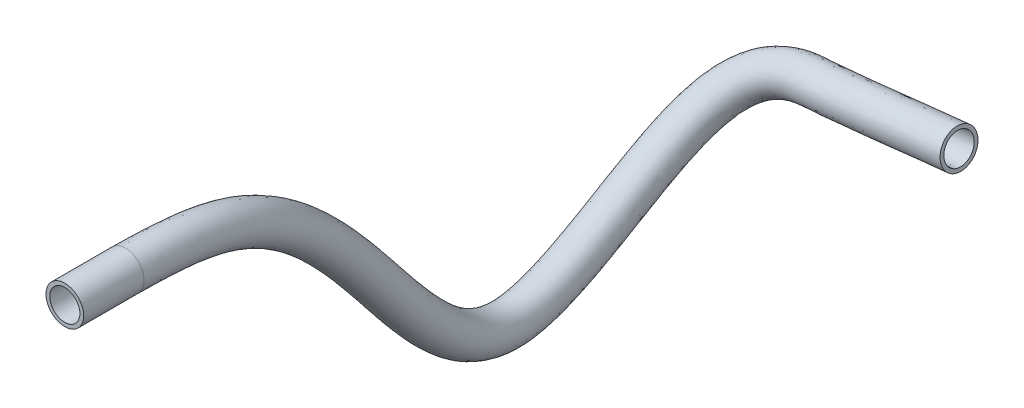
ISO-10303-21;
HEADER;
FILE_DESCRIPTION(('STEP AP214'),'2;1');
FILE_NAME('part.step','',(''),(''),'','','');
FILE_SCHEMA(('AUTOMOTIVE_DESIGN { 1 0 10303 214 1 1 1 1 }'));
ENDSEC;
DATA;
#1=APPLICATION_CONTEXT('core data for automotive mechanical design processes');
#2=APPLICATION_PROTOCOL_DEFINITION('international standard','automotive_design',2000,#1);
#3=PRODUCT_CONTEXT('',#1,'mechanical');
#4=PRODUCT('Part','Part','',(#3));
#5=PRODUCT_RELATED_PRODUCT_CATEGORY('part','',(#4));
#6=PRODUCT_DEFINITION_FORMATION('','',#4);
#7=PRODUCT_DEFINITION_CONTEXT('part definition',#1,'design');
#8=PRODUCT_DEFINITION('design','',#6,#7);
#9=PRODUCT_DEFINITION_SHAPE('','',#8);
#10=(LENGTH_UNIT() NAMED_UNIT(*) SI_UNIT(.MILLI.,.METRE.));
#11=(NAMED_UNIT(*) PLANE_ANGLE_UNIT() SI_UNIT($,.RADIAN.));
#12=(NAMED_UNIT(*) SI_UNIT($,.STERADIAN.) SOLID_ANGLE_UNIT());
#13=UNCERTAINTY_MEASURE_WITH_UNIT(LENGTH_MEASURE(1.E-05),#10,'distance_accuracy_value','');
#14=(GEOMETRIC_REPRESENTATION_CONTEXT(3) GLOBAL_UNCERTAINTY_ASSIGNED_CONTEXT((#13)) GLOBAL_UNIT_ASSIGNED_CONTEXT((#10,
#11,#12)) REPRESENTATION_CONTEXT('',''));
#15=CARTESIAN_POINT('',(0.,0.,0.));
#16=DIRECTION('',(0.,0.,1.));
#17=DIRECTION('',(1.,0.,0.));
#18=AXIS2_PLACEMENT_3D('',#15,#16,#17);
#19=CARTESIAN_POINT('',(0.,0.,0.));
#20=DIRECTION('',(0.,0.,1.));
#21=DIRECTION('',(1.,0.,0.));
#22=AXIS2_PLACEMENT_3D('',#19,#20,#21);
#23=CYLINDRICAL_SURFACE('',#22,2.5);
#24=CARTESIAN_POINT('',(2.44541645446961,-0.519555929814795,-6.68144466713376E-10));
#25=CARTESIAN_POINT('',(2.4418360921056,-0.536409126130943,0.000365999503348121));
#26=CARTESIAN_POINT('',(2.43808075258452,-0.553227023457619,0.000731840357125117));
#27=CARTESIAN_POINT('',(2.41815032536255,-0.63833374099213,0.0025862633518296));
#28=CARTESIAN_POINT('',(2.39926515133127,-0.706010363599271,0.00407102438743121));
#29=CARTESIAN_POINT('',(2.35586305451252,-0.839549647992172,0.00702141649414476));
#30=CARTESIAN_POINT('',(2.33134383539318,-0.905411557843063,0.00848703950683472));
#31=CARTESIAN_POINT('',(2.27679029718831,-1.03497495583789,0.0113918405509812));
#32=CARTESIAN_POINT('',(2.24674503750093,-1.09867185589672,0.0128309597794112));
#33=CARTESIAN_POINT('',(2.18137629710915,-1.22334051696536,0.0156705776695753));
#34=CARTESIAN_POINT('',(2.14604870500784,-1.28431010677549,0.0170710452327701));
#35=CARTESIAN_POINT('',(2.03266299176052,-1.4621869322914,0.0211938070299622));
#36=CARTESIAN_POINT('',(1.94705819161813,-1.57440257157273,0.023845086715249));
#37=CARTESIAN_POINT('',(1.75819001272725,-1.78284864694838,0.028882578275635));
#38=CARTESIAN_POINT('',(1.65492584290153,-1.87907836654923,0.0312687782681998));
#39=CARTESIAN_POINT('',(1.48911552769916,-2.00935286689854,0.0346021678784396));
#40=CARTESIAN_POINT('',(1.43198959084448,-2.05045271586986,0.0356728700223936));
#41=CARTESIAN_POINT('',(1.3145208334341,-2.12766653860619,0.037725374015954));
#42=CARTESIAN_POINT('',(1.25418117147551,-2.1637852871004,0.0387072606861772));
#43=CARTESIAN_POINT('',(1.13064153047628,-2.23082740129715,0.0405772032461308));
#44=CARTESIAN_POINT('',(1.06744017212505,-2.26174822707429,0.0414652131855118));
#45=CARTESIAN_POINT('',(0.938659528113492,-2.31816050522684,0.043141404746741));
#46=CARTESIAN_POINT('',(0.873079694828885,-2.34365069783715,0.0439295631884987));
#47=CARTESIAN_POINT('',(0.673525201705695,-2.4116511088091,0.0461356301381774));
#48=CARTESIAN_POINT('',(0.536577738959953,-2.44577661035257,0.0473975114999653));
#49=CARTESIAN_POINT('',(0.258969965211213,-2.49052806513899,0.0494690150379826));
#50=CARTESIAN_POINT('',(0.118309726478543,-2.50115447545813,0.0502786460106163));
#51=CARTESIAN_POINT('',(-0.162795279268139,-2.49864762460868,0.0514264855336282));
#52=CARTESIAN_POINT('',(-0.303240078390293,-2.48551833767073,0.051764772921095));
#53=CARTESIAN_POINT('',(-0.579931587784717,-2.43586437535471,0.0519609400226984));
#54=CARTESIAN_POINT('',(-0.716178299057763,-2.39933970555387,0.0518188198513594));
#55=CARTESIAN_POINT('',(-0.980581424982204,-2.30395769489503,0.0510573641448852));
#56=CARTESIAN_POINT('',(-1.1087385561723,-2.24510233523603,0.0504380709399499));
#57=CARTESIAN_POINT('',(-1.35340762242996,-2.10666008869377,0.0487356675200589));
#58=CARTESIAN_POINT('',(-1.46991938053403,-2.02707288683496,0.0476525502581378));
#59=CARTESIAN_POINT('',(-1.63333848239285,-1.89398205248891,0.0457017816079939));
#60=CARTESIAN_POINT('',(-1.68594573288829,-1.8473041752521,0.044996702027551));
#61=CARTESIAN_POINT('',(-1.78704490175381,-1.74968568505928,0.0434818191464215));
#62=CARTESIAN_POINT('',(-1.83553776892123,-1.69874606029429,0.0426720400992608));
#63=CARTESIAN_POINT('',(-1.92803598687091,-1.59298791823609,0.040953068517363));
#64=CARTESIAN_POINT('',(-1.97204343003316,-1.53817122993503,0.04004392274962));
#65=CARTESIAN_POINT('',(-2.05532207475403,-1.42499044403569,0.0381309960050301));
#66=CARTESIAN_POINT('',(-2.09458867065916,-1.36662297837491,0.0371271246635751));
#67=CARTESIAN_POINT('',(-2.20476819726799,-1.18688931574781,0.0339839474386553));
#68=CARTESIAN_POINT('',(-2.26814806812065,-1.06079195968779,0.0317114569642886));
#69=CARTESIAN_POINT('',(-2.37280045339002,-0.799744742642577,0.0268721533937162));
#70=CARTESIAN_POINT('',(-2.41407365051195,-0.664795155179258,0.0243053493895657));
#71=CARTESIAN_POINT('',(-2.45858129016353,-0.458642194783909,0.0202860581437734));
#72=CARTESIAN_POINT('',(-2.47052073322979,-0.389215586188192,0.0189163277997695));
#73=CARTESIAN_POINT('',(-2.48849711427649,-0.249644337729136,0.0161302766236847));
#74=CARTESIAN_POINT('',(-2.49453894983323,-0.179500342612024,0.0147139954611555));
#75=CARTESIAN_POINT('',(-2.50068091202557,-0.0390826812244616,0.0118463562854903));
#76=CARTESIAN_POINT('',(-2.5007914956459,0.0311905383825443,0.0103950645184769));
#77=CARTESIAN_POINT('',(-2.49509913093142,0.171483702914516,0.00746518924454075));
#78=CARTESIAN_POINT('',(-2.48929755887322,0.241503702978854,0.00598661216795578));
#79=CARTESIAN_POINT('',(-2.47380102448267,0.365047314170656,0.00334872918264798));
#80=CARTESIAN_POINT('',(-2.46528324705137,0.418720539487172,0.00219283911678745));
#81=CARTESIAN_POINT('',(-2.45197838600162,0.487917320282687,0.000689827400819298));
#82=CARTESIAN_POINT('',(-2.44877412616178,0.503752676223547,0.00034499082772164));
#83=CARTESIAN_POINT('',(-2.44541673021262,0.519554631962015,6.36999977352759E-10));
#84=B_SPLINE_CURVE_WITH_KNOTS('',3,(#24,#25,#26,#27,#28,#29,#30,#31,#32,#33,#34,#35,#36,#37,#38,
#39,#40,#41,#42,#43,#44,#45,#46,#47,#48,#49,#50,#51,#52,#53,#54,#55,#56,#57,#58,#59,#60,#61,#62,
#63,#64,#65,#66,#67,#68,#69,#70,#71,#72,#73,#74,#75,#76,#77,#78,#79,#80,#81,#82,#83),
.UNSPECIFIED.,.F.,.F.,(4,2,2,2,2,2,2,2,2,2,2,2,2,2,2,2,2,2,2,2,2,2,2,2,2,2,2,2,2,4),(0.,
0.0517037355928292,0.262258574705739,0.472899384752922,0.683961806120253,0.895189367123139,
1.31655002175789,1.73792955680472,1.94886763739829,2.15960209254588,2.37043922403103,
2.58132521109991,3.00256555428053,3.42379770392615,3.84495938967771,4.26612097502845,
4.68724520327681,5.10837582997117,5.31917164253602,5.5299187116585,5.74056701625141,
5.95141834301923,6.37272823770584,6.79402512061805,7.00519264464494,7.21618465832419,
7.42680467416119,7.63737567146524,7.80032668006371,7.8488034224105),.UNSPECIFIED.);
#85=CARTESIAN_POINT('',(-2.44541672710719,0.519554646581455,0.));
#86=VERTEX_POINT('',#85);
#87=CARTESIAN_POINT('',(2.44541645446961,-0.519555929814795,-6.68144466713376E-10));
#88=VERTEX_POINT('',#87);
#89=EDGE_CURVE('E56',#86,#88,#84,.F.);
#90=ORIENTED_EDGE('',*,*,#89,.T.);
#91=CARTESIAN_POINT('',(2.44541645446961,-0.519555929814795,-6.68144466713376E-10));
#92=CARTESIAN_POINT('',(2.44899736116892,-0.502702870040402,-0.000366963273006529));
#93=CARTESIAN_POINT('',(2.45240405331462,-0.485810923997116,-0.000733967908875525));
#94=CARTESIAN_POINT('',(2.46879724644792,-0.399951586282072,-0.00259532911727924));
#95=CARTESIAN_POINT('',(2.47905875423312,-0.330441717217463,-0.00408896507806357));
#96=CARTESIAN_POINT('',(2.49369881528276,-0.190789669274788,-0.00706338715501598));
#97=CARTESIAN_POINT('',(2.49807496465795,-0.120647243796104,-0.00854416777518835));
#98=CARTESIAN_POINT('',(2.50091005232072,0.0199059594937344,-0.0114851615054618));
#99=CARTESIAN_POINT('',(2.49935712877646,0.090316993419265,-0.0129453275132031));
#100=CARTESIAN_POINT('',(2.49032091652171,0.230795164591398,-0.0158322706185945));
#101=CARTESIAN_POINT('',(2.48283298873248,0.300861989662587,-0.0172590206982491));
#102=CARTESIAN_POINT('',(2.45155976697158,0.509474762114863,-0.0214672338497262));
#103=CARTESIAN_POINT('',(2.41897208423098,0.646802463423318,-0.0241843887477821));
#104=CARTESIAN_POINT('',(2.33116410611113,0.914032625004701,-0.0293638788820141));
#105=CARTESIAN_POINT('',(2.27594279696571,1.04393475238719,-0.03182620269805));
#106=CARTESIAN_POINT('',(2.17741863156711,1.23037077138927,-0.0352748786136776));
#107=CARTESIAN_POINT('',(2.14193625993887,1.29114667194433,-0.0363842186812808));
#108=CARTESIAN_POINT('',(2.06600525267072,1.40945108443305,-0.0385132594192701));
#109=CARTESIAN_POINT('',(2.02556144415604,1.46698267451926,-0.0395330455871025));
#110=CARTESIAN_POINT('',(1.93994814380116,1.5784620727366,-0.0414770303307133));
#111=CARTESIAN_POINT('',(1.89477635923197,1.63240812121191,-0.0424011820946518));
#112=CARTESIAN_POINT('',(1.80005269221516,1.73630651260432,-0.0441468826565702));
#113=CARTESIAN_POINT('',(1.75049979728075,1.78625792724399,-0.04496840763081));
#114=CARTESIAN_POINT('',(1.59582661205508,1.92951675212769,-0.0472689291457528));
#115=CARTESIAN_POINT('',(1.48458130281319,2.0163723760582,-0.0485863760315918));
#116=CARTESIAN_POINT('',(1.24914415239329,2.17012319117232,-0.050748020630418));
#117=CARTESIAN_POINT('',(1.12495256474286,2.23701877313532,-0.0515922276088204));
#118=CARTESIAN_POINT('',(0.867108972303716,2.34901337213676,-0.0527845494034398));
#119=CARTESIAN_POINT('',(0.73345875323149,2.39411649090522,-0.053132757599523));
#120=CARTESIAN_POINT('',(0.460482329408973,2.46124185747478,-0.0533230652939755));
#121=CARTESIAN_POINT('',(0.321156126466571,2.48326411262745,-0.0531651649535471));
#122=CARTESIAN_POINT('',(0.040817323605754,2.50361619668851,-0.0523481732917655));
#123=CARTESIAN_POINT('',(-0.100195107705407,2.50194837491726,-0.0516891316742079));
#124=CARTESIAN_POINT('',(-0.380009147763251,2.47493859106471,-0.0498874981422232));
#125=CARTESIAN_POINT('',(-0.518810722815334,2.44959626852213,-0.0487448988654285));
#126=CARTESIAN_POINT('',(-0.722219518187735,2.39444386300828,-0.0466950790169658));
#127=CARTESIAN_POINT('',(-0.789259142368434,2.37318679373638,-0.0459553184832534));
#128=CARTESIAN_POINT('',(-0.921311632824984,2.32510519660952,-0.0443687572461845));
#129=CARTESIAN_POINT('',(-0.986324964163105,2.29828195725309,-0.0435219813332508));
#130=CARTESIAN_POINT('',(-1.11382882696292,2.23926738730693,-0.041727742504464));
#131=CARTESIAN_POINT('',(-1.17632052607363,2.2070785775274,-0.0407803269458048));
#132=CARTESIAN_POINT('',(-1.29841914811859,2.13753458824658,-0.0387906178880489));
#133=CARTESIAN_POINT('',(-1.35802323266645,2.10017445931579,-0.0377482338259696));
#134=CARTESIAN_POINT('',(-1.53176056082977,1.9807622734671,-0.0344907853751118));
#135=CARTESIAN_POINT('',(-1.64093473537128,1.89132466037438,-0.0321437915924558));
#136=CARTESIAN_POINT('',(-1.84268416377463,1.69537289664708,-0.0271675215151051));
#137=CARTESIAN_POINT('',(-1.93525992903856,1.58885927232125,-0.0245382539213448));
#138=CARTESIAN_POINT('',(-2.0597402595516,1.41860665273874,-0.0204396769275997));
#139=CARTESIAN_POINT('',(-2.09887565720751,1.36003036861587,-0.0190458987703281));
#140=CARTESIAN_POINT('',(-2.17204561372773,1.23982184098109,-0.0162172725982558));
#141=CARTESIAN_POINT('',(-2.20608438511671,1.17819217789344,-0.0147824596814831));
#142=CARTESIAN_POINT('',(-2.26878603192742,1.05239849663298,-0.0118838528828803));
#143=CARTESIAN_POINT('',(-2.29745828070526,0.988239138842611,-0.0104201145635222));
#144=CARTESIAN_POINT('',(-2.34929690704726,0.857747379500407,-0.00747176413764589));
#145=CARTESIAN_POINT('',(-2.37246456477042,0.791415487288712,-0.00598715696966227));
#146=CARTESIAN_POINT('',(-2.40853387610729,0.672246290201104,-0.00334457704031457));
#147=CARTESIAN_POINT('',(-2.42257228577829,0.619751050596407,-0.00218869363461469));
#148=CARTESIAN_POINT('',(-2.43854883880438,0.55112691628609,-0.000688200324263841));
#149=CARTESIAN_POINT('',(-2.44205952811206,0.535356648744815,-0.000344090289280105));
#150=CARTESIAN_POINT('',(-2.44541673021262,0.519554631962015,6.36999977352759E-10));
#151=B_SPLINE_CURVE_WITH_KNOTS('',3,(#91,#92,#93,#94,#95,#96,#97,#98,#99,#100,#101,#102,#103,
#104,#105,#106,#107,#108,#109,#110,#111,#112,#113,#114,#115,#116,#117,#118,#119,#120,#121,#122,
#123,#124,#125,#126,#127,#128,#129,#130,#131,#132,#133,#134,#135,#136,#137,#138,#139,#140,#141,
#142,#143,#144,#145,#146,#147,#148,#149,#150),.UNSPECIFIED.,.F.,.F.,(4,2,2,2,2,2,2,2,2,2,2,2,2,
2,2,2,2,2,2,2,2,2,2,2,2,2,2,2,2,4),(0.,0.051703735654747,0.262262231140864,0.472906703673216,
0.683972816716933,0.895204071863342,1.3165719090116,1.73795862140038,1.94890144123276,
2.15964063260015,2.37048249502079,2.58137321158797,3.00261776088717,3.4238540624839,
3.84501104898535,4.2661679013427,4.6872829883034,5.10840448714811,5.31919769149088,
5.52994215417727,5.74058788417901,5.95143663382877,6.3727558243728,6.79406203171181,
7.00523428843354,7.21623102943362,7.42685572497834,7.63743138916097,7.80036751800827,
7.84884426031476),.UNSPECIFIED.);
#152=EDGE_CURVE('E68',#86,#88,#151,.F.);
#153=ORIENTED_EDGE('',*,*,#152,.F.);
#154=EDGE_LOOP('',(#90,#153));
#155=FACE_BOUND('',#154,.T.);
#156=CARTESIAN_POINT('',(0.,0.,7.98335146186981));
#157=DIRECTION('',(0.,0.,1.));
#158=DIRECTION('',(1.,0.,0.));
#159=AXIS2_PLACEMENT_3D('',#156,#157,#158);
#160=CIRCLE('',#159,2.5);
#161=CARTESIAN_POINT('',(2.5,0.,7.98335146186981));
#162=VERTEX_POINT('',#161);
#163=EDGE_CURVE('E49',#162,#162,#160,.T.);
#164=ORIENTED_EDGE('',*,*,#163,.F.);
#165=EDGE_LOOP('',(#164));
#166=FACE_BOUND('',#165,.T.);
#167=ADVANCED_FACE('F39',(#155,#166),#23,.T.);
#168=CARTESIAN_POINT('',(0.,0.,7.98335146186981));
#169=DIRECTION('',(0.,0.,1.));
#170=DIRECTION('',(1.,0.,0.));
#171=AXIS2_PLACEMENT_3D('',#168,#169,#170);
#172=PLANE('',#171);
#173=CARTESIAN_POINT('',(0.,0.,7.98335146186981));
#174=DIRECTION('',(0.,0.,1.));
#175=DIRECTION('',(1.,0.,0.));
#176=AXIS2_PLACEMENT_3D('',#173,#174,#175);
#177=CIRCLE('',#176,2.);
#178=CARTESIAN_POINT('',(2.,0.,7.98335146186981));
#179=VERTEX_POINT('',#178);
#180=EDGE_CURVE('E11',#179,#179,#177,.F.);
#181=ORIENTED_EDGE('',*,*,#180,.T.);
#182=EDGE_LOOP('',(#181));
#183=FACE_BOUND('',#182,.T.);
#184=ORIENTED_EDGE('',*,*,#163,.T.);
#185=EDGE_LOOP('',(#184));
#186=FACE_BOUND('',#185,.T.);
#187=ADVANCED_FACE('F140',(#183,#186),#172,.T.);
#188=CARTESIAN_POINT('',(0.,0.,0.));
#189=DIRECTION('',(0.,0.,1.));
#190=DIRECTION('',(1.,0.,0.));
#191=AXIS2_PLACEMENT_3D('',#188,#189,#190);
#192=CYLINDRICAL_SURFACE('',#191,2.);
#193=CARTESIAN_POINT('',(2.00007841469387,0.000369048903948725,1.54957968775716E-09));
#194=CARTESIAN_POINT('',(2.00005267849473,-0.112162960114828,1.9410611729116E-09));
#195=CARTESIAN_POINT('',(1.99052369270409,-0.224774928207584,5.20387265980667E-10));
#196=CARTESIAN_POINT('',(1.95268662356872,-0.446894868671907,-5.21015950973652E-10));
#197=CARTESIAN_POINT('',(1.92435586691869,-0.556398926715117,-1.39568656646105E-10));
#198=CARTESIAN_POINT('',(1.84971913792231,-0.769053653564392,1.3951594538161E-10));
#199=CARTESIAN_POINT('',(1.80342159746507,-0.872207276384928,3.73799493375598E-11));
#200=CARTESIAN_POINT('',(1.6941734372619,-1.06924619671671,-3.73705713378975E-11));
#201=CARTESIAN_POINT('',(1.63122699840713,-1.16313381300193,-1.00175842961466E-11));
#202=CARTESIAN_POINT('',(1.4904680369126,-1.33899200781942,1.00066494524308E-11));
#203=CARTESIAN_POINT('',(1.41265750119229,-1.42096417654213,2.68252842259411E-12));
#204=CARTESIAN_POINT('',(1.24436715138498,-1.57067364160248,-2.68262643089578E-12));
#205=CARTESIAN_POINT('',(1.15388687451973,-1.63841041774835,-7.23321079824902E-13));
#206=CARTESIAN_POINT('',(0.962897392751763,-1.75766944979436,7.12956796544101E-13));
#207=CARTESIAN_POINT('',(0.862395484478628,-1.809203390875,1.91722638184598E-13));
#208=CARTESIAN_POINT('',(0.654161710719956,-1.89465179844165,-1.91721402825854E-13));
#209=CARTESIAN_POINT('',(0.546429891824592,-1.92856637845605,0.));
#210=CARTESIAN_POINT('',(0.326884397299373,-1.97778659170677,0.));
#211=CARTESIAN_POINT('',(0.215073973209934,-1.99310672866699,0.));
#212=CARTESIAN_POINT('',(-0.00953130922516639,-2.0047464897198,0.));
#213=CARTESIAN_POINT('',(-0.122326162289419,-2.0010662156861,0.));
#214=CARTESIAN_POINT('',(-0.345630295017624,-1.97481500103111,0.));
#215=CARTESIAN_POINT('',(-0.456140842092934,-1.95225484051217,0.));
#216=CARTESIAN_POINT('',(-0.671804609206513,-1.88889840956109,0.));
#217=CARTESIAN_POINT('',(-0.776957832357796,-1.84810214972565,0.));
#218=CARTESIAN_POINT('',(-0.978905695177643,-1.74944180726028,0.));
#219=CARTESIAN_POINT('',(-1.07570166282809,-1.69158044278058,0.));
#220=CARTESIAN_POINT('',(-1.25820935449,-1.56043306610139,0.));
#221=CARTESIAN_POINT('',(-1.34392107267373,-1.48714704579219,0.));
#222=CARTESIAN_POINT('',(-1.50185804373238,-1.32720835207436,0.));
#223=CARTESIAN_POINT('',(-1.57407907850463,-1.24055151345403,0.));
#224=CARTESIAN_POINT('',(-1.70295927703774,-1.05634990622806,0.));
#225=CARTESIAN_POINT('',(-1.75961838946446,-0.958805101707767,0.));
#226=CARTESIAN_POINT('',(-1.85580881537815,-0.755526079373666,0.));
#227=CARTESIAN_POINT('',(-1.89532842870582,-0.649786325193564,0.));
#228=CARTESIAN_POINT('',(-1.95607058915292,-0.433176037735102,0.));
#229=CARTESIAN_POINT('',(-1.97729305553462,-0.32230548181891,0.));
#230=CARTESIAN_POINT('',(-2.0008557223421,-0.098484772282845,0.));
#231=CARTESIAN_POINT('',(-2.00318059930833,0.0144669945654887,0.));
#232=CARTESIAN_POINT('',(-1.98884700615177,0.239159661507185,0.));
#233=CARTESIAN_POINT('',(-1.9721884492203,0.350900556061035,0.));
#234=CARTESIAN_POINT('',(-1.92034593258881,0.570072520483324,0.));
#235=CARTESIAN_POINT('',(-1.88515047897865,0.677500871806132,0.));
#236=CARTESIAN_POINT('',(-1.79722410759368,0.884924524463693,0.));
#237=CARTESIAN_POINT('',(-1.74449318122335,0.984919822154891,0.));
#238=CARTESIAN_POINT('',(-1.62298692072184,1.17463940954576,0.));
#239=CARTESIAN_POINT('',(-1.55421107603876,1.26436337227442,0.));
#240=CARTESIAN_POINT('',(-1.40256432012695,1.43098329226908,0.));
#241=CARTESIAN_POINT('',(-1.31969343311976,1.50787927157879,0.));
#242=CARTESIAN_POINT('',(-1.14225770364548,1.64661146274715,0.));
#243=CARTESIAN_POINT('',(-1.04769952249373,1.70845619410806,0.));
#244=CARTESIAN_POINT('',(-0.849535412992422,1.81537684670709,0.));
#245=CARTESIAN_POINT('',(-0.74592953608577,1.8604528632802,0.));
#246=CARTESIAN_POINT('',(-0.532707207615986,1.9325149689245,0.));
#247=CARTESIAN_POINT('',(-0.423096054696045,1.95951673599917,0.));
#248=CARTESIAN_POINT('',(-0.200894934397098,1.99471892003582,0.));
#249=CARTESIAN_POINT('',(-0.0883049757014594,2.00291939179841,0.));
#250=CARTESIAN_POINT('',(0.136562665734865,2.00028225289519,0.));
#251=CARTESIAN_POINT('',(0.248840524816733,1.98945966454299,0.));
#252=CARTESIAN_POINT('',(0.469983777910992,1.94911095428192,0.));
#253=CARTESIAN_POINT('',(0.578849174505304,1.91958484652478,0.));
#254=CARTESIAN_POINT('',(0.790038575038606,1.84268218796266,0.));
#255=CARTESIAN_POINT('',(0.892364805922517,1.79531175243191,-2.55905760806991E-13));
#256=CARTESIAN_POINT('',(1.0876102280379,1.68406937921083,2.55895781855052E-13));
#257=CARTESIAN_POINT('',(1.18052978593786,1.62019808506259,9.60029025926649E-13));
#258=CARTESIAN_POINT('',(1.35434445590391,1.47776251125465,-9.37930409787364E-13));
#259=CARTESIAN_POINT('',(1.43523813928,1.39919648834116,-3.54041557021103E-12));
#260=CARTESIAN_POINT('',(1.58271897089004,1.22958436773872,3.54130683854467E-12));
#261=CARTESIAN_POINT('',(1.64930251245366,1.13853513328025,1.32286076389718E-11));
#262=CARTESIAN_POINT('',(1.76632542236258,0.946457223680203,-1.32460662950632E-11));
#263=CARTESIAN_POINT('',(1.81674554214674,0.845416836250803,-4.94624541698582E-11));
#264=CARTESIAN_POINT('',(1.89986594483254,0.636389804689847,4.94032673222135E-11));
#265=CARTESIAN_POINT('',(1.93258735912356,0.528411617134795,1.84280452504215E-10));
#266=CARTESIAN_POINT('',(1.97067652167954,0.349851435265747,-1.15196736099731E-10));
#267=CARTESIAN_POINT('',(1.98170010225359,0.280424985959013,-3.55113476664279E-10));
#268=CARTESIAN_POINT('',(1.99640908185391,0.140799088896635,3.55113688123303E-10));
#269=CARTESIAN_POINT('',(2.00009447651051,0.0705996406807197,1.30525830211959E-09));
#270=CARTESIAN_POINT('',(2.00007841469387,0.000369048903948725,1.54957968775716E-09));
#271=B_SPLINE_CURVE_WITH_KNOTS('',3,(#193,#194,#195,#196,#197,#198,#199,#200,#201,#202,#203,
#204,#205,#206,#207,#208,#209,#210,#211,#212,#213,#214,#215,#216,#217,#218,#219,#220,#221,#222,
#223,#224,#225,#226,#227,#228,#229,#230,#231,#232,#233,#234,#235,#236,#237,#238,#239,#240,#241,
#242,#243,#244,#245,#246,#247,#248,#249,#250,#251,#252,#253,#254,#255,#256,#257,#258,#259,#260,
#261,#262,#263,#264,#265,#266,#267,#268,#269,#270),.UNSPECIFIED.,.T.,.F.,(4,2,2,2,2,2,2,2,2,2,2,
2,2,2,2,2,2,2,2,2,2,2,2,2,2,2,2,2,2,2,2,2,2,2,2,2,2,2,4),(0.,0.337339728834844,0.67508700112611,
1.01267595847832,1.35018022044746,1.68763939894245,2.02511090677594,2.36233847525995,
2.69956387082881,3.03652606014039,3.37348644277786,3.71025455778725,4.04702247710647,
4.38373678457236,4.72045126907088,5.05727085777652,5.39409155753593,5.73114182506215,
6.06819357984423,6.40551861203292,6.74284518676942,7.08038116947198,7.41791731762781,
7.75546420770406,8.09301051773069,8.43036531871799,8.76771820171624,9.10477807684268,
9.44183696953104,9.77862980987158,10.1154223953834,10.4520996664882,10.7887638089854,
11.1254679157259,11.4622567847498,11.7994452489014,12.1362302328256,12.3467619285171,
12.5572937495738),.UNSPECIFIED.);
#272=CARTESIAN_POINT('',(1.95633319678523,-0.415644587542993,-5.31128656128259E-10));
#273=VERTEX_POINT('',#272);
#274=CARTESIAN_POINT('',(-1.95633337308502,0.415643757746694,0.));
#275=VERTEX_POINT('',#274);
#276=EDGE_CURVE('E42',#273,#275,#271,.T.);
#277=ORIENTED_EDGE('',*,*,#276,.T.);
#278=CARTESIAN_POINT('',(1.95633319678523,-0.415644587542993,-5.31128656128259E-10));
#279=CARTESIAN_POINT('',(1.95949501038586,-0.400764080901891,-0.000324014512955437));
#280=CARTESIAN_POINT('',(1.96248702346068,-0.385845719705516,-0.000648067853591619));
#281=CARTESIAN_POINT('',(1.97571965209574,-0.315723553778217,-0.00216757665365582));
#282=CARTESIAN_POINT('',(1.98380969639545,-0.260097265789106,-0.0033623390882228));
#283=CARTESIAN_POINT('',(1.99528208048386,-0.148349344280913,-0.00574135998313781));
#284=CARTESIAN_POINT('',(1.99866257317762,-0.0922275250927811,-0.00692561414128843));
#285=CARTESIAN_POINT('',(2.00068922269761,0.0202190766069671,-0.0092774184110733));
#286=CARTESIAN_POINT('',(1.99932601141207,0.0765440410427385,-0.0104449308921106));
#287=CARTESIAN_POINT('',(1.99185610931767,0.188908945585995,-0.0127530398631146));
#288=CARTESIAN_POINT('',(1.98574568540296,0.244948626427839,-0.0138936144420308));
#289=CARTESIAN_POINT('',(1.9603692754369,0.411784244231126,-0.0172574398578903));
#290=CARTESIAN_POINT('',(1.93406313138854,0.52159073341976,-0.0194289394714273));
#291=CARTESIAN_POINT('',(1.86335971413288,0.735222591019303,-0.0235672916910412));
#292=CARTESIAN_POINT('',(1.8189616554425,0.839047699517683,-0.0255341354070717));
#293=CARTESIAN_POINT('',(1.73981937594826,0.988030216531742,-0.0282881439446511));
#294=CARTESIAN_POINT('',(1.711327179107,1.03659191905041,-0.0291739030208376));
#295=CARTESIAN_POINT('',(1.65038606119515,1.13109903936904,-0.0308733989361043));
#296=CARTESIAN_POINT('',(1.6179409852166,1.17704693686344,-0.0316872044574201));
#297=CARTESIAN_POINT('',(1.51492785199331,1.31057610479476,-0.0340135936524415));
#298=CARTESIAN_POINT('',(1.43866641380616,1.39387191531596,-0.0354116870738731));
#299=CARTESIAN_POINT('',(1.2732957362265,1.54641060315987,-0.0378581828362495));
#300=CARTESIAN_POINT('',(1.18418993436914,1.61565722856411,-0.0389066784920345));
#301=CARTESIAN_POINT('',(0.995606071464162,1.73821953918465,-0.0406257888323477));
#302=CARTESIAN_POINT('',(0.896128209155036,1.79153552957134,-0.0412964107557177));
#303=CARTESIAN_POINT('',(0.689653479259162,1.88069763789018,-0.0422403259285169));
#304=CARTESIAN_POINT('',(0.582658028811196,1.91654703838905,-0.0425136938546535));
#305=CARTESIAN_POINT('',(0.364167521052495,1.9697778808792,-0.0426556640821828));
#306=CARTESIAN_POINT('',(0.252672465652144,1.98715933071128,-0.0425242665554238));
#307=CARTESIAN_POINT('',(0.0283556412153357,2.00295635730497,-0.0418603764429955));
#308=CARTESIAN_POINT('',(-0.0844659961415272,2.00137380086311,-0.0413279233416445));
#309=CARTESIAN_POINT('',(-0.30822899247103,1.97930335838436,-0.0398773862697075));
#310=CARTESIAN_POINT('',(-0.419170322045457,1.9588151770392,-0.0389592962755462));
#311=CARTESIAN_POINT('',(-0.636097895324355,1.89947576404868,-0.0367624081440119));
#312=CARTESIAN_POINT('',(-0.742083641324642,1.86062269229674,-0.0354835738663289));
#313=CARTESIAN_POINT('',(-0.894915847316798,1.78949585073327,-0.0333248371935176));
#314=CARTESIAN_POINT('',(-0.944842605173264,1.7636408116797,-0.0325650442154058));
#315=CARTESIAN_POINT('',(-1.0423934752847,1.70779876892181,-0.0309695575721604));
#316=CARTESIAN_POINT('',(-1.09001532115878,1.67780780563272,-0.0301337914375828));
#317=CARTESIAN_POINT('',(-1.22880471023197,1.58197910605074,-0.027522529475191));
#318=CARTESIAN_POINT('',(-1.31598846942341,1.5102424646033,-0.025641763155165));
#319=CARTESIAN_POINT('',(-1.47705023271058,1.3531357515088,-0.0216551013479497));
#320=CARTESIAN_POINT('',(-1.55092867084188,1.26776612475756,-0.0195492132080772));
#321=CARTESIAN_POINT('',(-1.65022154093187,1.13135009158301,-0.0162672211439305));
#322=CARTESIAN_POINT('',(-1.68142978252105,1.0844212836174,-0.0151512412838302));
#323=CARTESIAN_POINT('',(-1.73976050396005,0.988127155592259,-0.0128866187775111));
#324=CARTESIAN_POINT('',(-1.76688633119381,0.938763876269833,-0.0117380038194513));
#325=CARTESIAN_POINT('',(-1.8168318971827,0.838020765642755,-0.0094178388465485));
#326=CARTESIAN_POINT('',(-1.83965926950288,0.786644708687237,-0.00824633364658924));
#327=CARTESIAN_POINT('',(-1.88090541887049,0.682163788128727,-0.00588683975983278));
#328=CARTESIAN_POINT('',(-1.89932532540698,0.629059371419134,-0.0046988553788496));
#329=CARTESIAN_POINT('',(-1.92712572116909,0.536495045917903,-0.00264720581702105));
#330=CARTESIAN_POINT('',(-1.93759461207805,0.497359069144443,-0.00178546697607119));
#331=CARTESIAN_POINT('',(-1.95017438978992,0.443879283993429,-0.000615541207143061));
#332=CARTESIAN_POINT('',(-1.95333058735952,0.429777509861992,-0.000307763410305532));
#333=CARTESIAN_POINT('',(-1.95633337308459,0.415643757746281,5.11258570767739E-10));
#334=B_SPLINE_CURVE_WITH_KNOTS('',3,(#278,#279,#280,#281,#282,#283,#284,#285,#286,#287,#288,
#289,#290,#291,#292,#293,#294,#295,#296,#297,#298,#299,#300,#301,#302,#303,#304,#305,#306,#307,
#308,#309,#310,#311,#312,#313,#314,#315,#316,#317,#318,#319,#320,#321,#322,#323,#324,#325,#326,
#327,#328,#329,#330,#331,#332,#333),.UNSPECIFIED.,.F.,.F.,(4,2,2,2,2,2,2,2,2,2,2,2,2,2,2,2,2,2,
2,2,2,2,2,2,2,2,2,4),(0.,0.0456522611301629,0.214102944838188,0.382619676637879,
0.551469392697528,0.720452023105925,1.05754628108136,1.39465517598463,1.56340937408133,
1.73200071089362,2.06908584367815,2.40608092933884,2.7430695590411,3.07999483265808,
3.41691996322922,3.75381192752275,4.09070915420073,4.42764014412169,4.59615665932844,
4.76483564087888,5.10189174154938,5.43893684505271,5.60787754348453,5.77667895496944,
5.9451777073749,6.11363323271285,6.23512078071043,6.27847914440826),.UNSPECIFIED.);
#335=EDGE_CURVE('E63',#275,#273,#334,.F.);
#336=ORIENTED_EDGE('',*,*,#335,.T.);
#337=EDGE_LOOP('',(#277,#336));
#338=FACE_BOUND('',#337,.T.);
#339=ORIENTED_EDGE('',*,*,#180,.F.);
#340=EDGE_LOOP('',(#339));
#341=FACE_BOUND('',#340,.T.);
#342=ADVANCED_FACE('F131',(#338,#341),#192,.F.);
#343=CARTESIAN_POINT('',(29.7424014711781,-13.5473328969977,-80.1153573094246));
#344=CARTESIAN_POINT('',(28.4103268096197,-13.6786142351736,-80.1178738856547));
#345=CARTESIAN_POINT('',(25.2920631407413,-14.0089678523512,-80.096072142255));
#346=CARTESIAN_POINT('',(18.6884194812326,-14.7087929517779,-80.0665605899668));
#347=CARTESIAN_POINT('',(15.1956287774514,-15.0789533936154,-80.0587382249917));
#348=CARTESIAN_POINT('',(12.1472985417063,-15.3872644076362,-80.1031904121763));
#349=CARTESIAN_POINT('',(11.4902521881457,-15.4508989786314,-80.1226899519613));
#350=CARTESIAN_POINT('',(10.4512016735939,-15.5566247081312,-80.1572036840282));
#351=CARTESIAN_POINT('',(10.0742968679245,-15.6007609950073,-80.1764379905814));
#352=CARTESIAN_POINT('',(9.06908858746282,-15.7247797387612,-80.1703737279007));
#353=CARTESIAN_POINT('',(8.46939412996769,-15.8272729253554,-80.1182076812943));
#354=CARTESIAN_POINT('',(6.81835104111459,-16.2135877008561,-79.8764554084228));
#355=CARTESIAN_POINT('',(5.93857870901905,-16.5565520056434,-79.5853613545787));
#356=CARTESIAN_POINT('',(4.43747139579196,-17.410880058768,-78.728736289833));
#357=CARTESIAN_POINT('',(3.8063492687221,-17.9298609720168,-78.1567689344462));
#358=CARTESIAN_POINT('',(2.72268937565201,-19.2123399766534,-76.6006272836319));
#359=CARTESIAN_POINT('',(2.27823063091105,-19.9753902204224,-75.6147389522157));
#360=CARTESIAN_POINT('',(1.75066031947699,-21.3522522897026,-73.6932776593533));
#361=CARTESIAN_POINT('',(1.58909184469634,-21.9433617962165,-72.9440120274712));
#362=CARTESIAN_POINT('',(1.33871234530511,-23.1395151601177,-71.2989016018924));
#363=CARTESIAN_POINT('',(1.24823320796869,-23.7585190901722,-70.4146710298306));
#364=CARTESIAN_POINT('',(1.06685421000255,-25.617443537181,-67.6250549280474));
#365=CARTESIAN_POINT('',(1.06617417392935,-26.8588905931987,-65.5833866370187));
#366=CARTESIAN_POINT('',(1.20740479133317,-29.0445716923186,-61.3673756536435));
#367=CARTESIAN_POINT('',(1.34891624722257,-29.9894348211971,-59.1928604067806));
#368=CARTESIAN_POINT('',(1.669297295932,-31.2910970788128,-54.9225334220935));
#369=CARTESIAN_POINT('',(1.84825745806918,-31.6492997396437,-52.8262642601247));
#370=CARTESIAN_POINT('',(2.12566832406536,-31.4778752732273,-49.0631327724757));
#371=CARTESIAN_POINT('',(2.22776642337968,-31.0148442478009,-47.3938640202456));
#372=CARTESIAN_POINT('',(2.38018170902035,-29.5056145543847,-44.2549494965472));
#373=CARTESIAN_POINT('',(2.43057519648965,-28.4602881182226,-42.7849397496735));
#374=CARTESIAN_POINT('',(2.52126591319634,-24.718952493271,-38.5438330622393));
#375=CARTESIAN_POINT('',(2.50127132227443,-21.417412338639,-35.9390625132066));
#376=CARTESIAN_POINT('',(2.38749138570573,-14.5605965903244,-30.4842708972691));
#377=CARTESIAN_POINT('',(2.29359215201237,-11.0047473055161,-27.6350252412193));
#378=CARTESIAN_POINT('',(2.16123543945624,-6.49847260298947,-22.6789918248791));
#379=CARTESIAN_POINT('',(2.11852824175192,-5.13432055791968,-20.913439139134));
#380=CARTESIAN_POINT('',(2.0465357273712,-2.85072800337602,-17.0726260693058));
#381=CARTESIAN_POINT('',(2.01724839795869,-1.93124284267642,-14.9974349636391));
#382=CARTESIAN_POINT('',(1.98166561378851,-0.670209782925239,-10.3247433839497));
#383=CARTESIAN_POINT('',(1.9767435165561,-0.363483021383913,-7.70009787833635));
#384=CARTESIAN_POINT('',(1.97992237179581,-0.129660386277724,-4.24880122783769));
#385=CARTESIAN_POINT('',(1.98274061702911,-0.0893740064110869,-3.17926470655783));
#386=CARTESIAN_POINT('',(1.98840874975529,-0.0495193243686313,-1.7992531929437));
#387=CARTESIAN_POINT('',(1.9905382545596,-0.0396618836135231,-1.37663145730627));
#388=CARTESIAN_POINT('',(1.99394065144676,-0.0255387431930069,-0.811818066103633));
#389=CARTESIAN_POINT('',(1.99510945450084,-0.0209412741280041,-0.635068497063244));
#390=CARTESIAN_POINT('',(1.99749016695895,-0.0112266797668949,-0.306845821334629));
#391=CARTESIAN_POINT('',(1.99869661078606,-0.0061347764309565,-0.156011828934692));
#392=CARTESIAN_POINT('',(2.00050898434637,0.00239561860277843,0.0486137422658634));
#393=CARTESIAN_POINT('',(2.00110165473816,0.00518585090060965,0.11551212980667));
#394=CARTESIAN_POINT('',(2.00169166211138,0.00796320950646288,0.182118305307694));
#395=CARTESIAN_POINT('',(29.9258781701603,-15.3405691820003,-83.6861611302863));
#396=CARTESIAN_POINT('',(28.5658581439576,-15.4746046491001,-83.6887305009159));
#397=CARTESIAN_POINT('',(25.4605399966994,-15.8037338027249,-83.6668512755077));
#398=CARTESIAN_POINT('',(18.8683016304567,-16.5023502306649,-83.6373906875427));
#399=CARTESIAN_POINT('',(15.3733727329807,-16.8725986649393,-83.6300571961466));
#400=CARTESIAN_POINT('',(12.4027146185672,-17.1730538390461,-83.6733767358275));
#401=CARTESIAN_POINT('',(11.7724631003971,-17.2340713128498,-83.6921389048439));
#402=CARTESIAN_POINT('',(10.7685607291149,-17.3362113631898,-83.725489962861));
#403=CARTESIAN_POINT('',(10.3945466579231,-17.3700997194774,-83.7496742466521));
#404=CARTESIAN_POINT('',(9.30580837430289,-17.547564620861,-83.72367728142));
#405=CARTESIAN_POINT('',(8.63055865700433,-17.7127585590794,-83.643519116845));
#406=CARTESIAN_POINT('',(6.76697305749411,-18.2637194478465,-83.3158918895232));
#407=CARTESIAN_POINT('',(5.73325743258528,-18.7379256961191,-82.9389275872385));
#408=CARTESIAN_POINT('',(4.01186922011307,-19.8847874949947,-81.8505305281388));
#409=CARTESIAN_POINT('',(3.32150526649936,-20.5595841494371,-81.1373543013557));
#410=CARTESIAN_POINT('',(2.24695422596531,-22.1091806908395,-79.3239335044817));
#411=CARTESIAN_POINT('',(1.86504489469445,-22.9839892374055,-78.2232701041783));
#412=CARTESIAN_POINT('',(1.50089707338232,-24.496956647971,-76.1544698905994));
#413=CARTESIAN_POINT('',(1.29516317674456,-25.1133820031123,-75.366405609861));
#414=CARTESIAN_POINT('',(1.03048838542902,-26.3777279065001,-73.6275039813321));
#415=CARTESIAN_POINT('',(0.934911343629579,-27.0313109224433,-72.6938950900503));
#416=CARTESIAN_POINT('',(0.742983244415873,-28.9978763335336,-69.7427373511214));
#417=CARTESIAN_POINT('',(0.74126596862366,-30.3166287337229,-67.5768250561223));
#418=CARTESIAN_POINT('',(0.893625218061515,-32.6752129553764,-63.0272857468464));
#419=CARTESIAN_POINT('',(1.04735783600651,-33.718111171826,-60.6456481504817));
#420=CARTESIAN_POINT('',(1.41391046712,-35.2078364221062,-55.7582890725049));
#421=CARTESIAN_POINT('',(1.62895510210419,-35.6686785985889,-53.2443897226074));
#422=CARTESIAN_POINT('',(1.99312576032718,-35.4436412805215,-48.3043429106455));
#423=CARTESIAN_POINT('',(2.12890694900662,-34.8193792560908,-46.0774404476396));
#424=CARTESIAN_POINT('',(2.32206631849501,-32.9066047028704,-42.0992316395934));
#425=CARTESIAN_POINT('',(2.38116514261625,-31.6355507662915,-40.3382472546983));
#426=CARTESIAN_POINT('',(2.48465978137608,-27.3653202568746,-35.4975974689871));
#427=CARTESIAN_POINT('',(2.45916788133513,-23.9003777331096,-32.8032685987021));
#428=CARTESIAN_POINT('',(2.34563589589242,-17.0586807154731,-27.3605043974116));
#429=CARTESIAN_POINT('',(2.25535845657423,-13.678023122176,-24.6294219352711));
#430=CARTESIAN_POINT('',(2.13562000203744,-9.60159210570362,-20.1461332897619));
#431=CARTESIAN_POINT('',(2.09820263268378,-8.40783855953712,-18.5923071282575));
#432=CARTESIAN_POINT('',(2.03659887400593,-6.45380218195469,-15.305780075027));
#433=CARTESIAN_POINT('',(2.01228689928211,-5.69062908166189,-13.5755947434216));
#434=CARTESIAN_POINT('',(1.98264950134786,-4.64029732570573,-9.68364574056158));
#435=CARTESIAN_POINT('',(1.97753146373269,-4.34429936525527,-7.28159961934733));
#436=CARTESIAN_POINT('',(1.98050209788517,-4.12552934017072,-4.05248257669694));
#437=CARTESIAN_POINT('',(1.98315023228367,-4.08692134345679,-3.03659181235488));
#438=CARTESIAN_POINT('',(1.98864868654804,-4.04824496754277,-1.69737933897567));
#439=CARTESIAN_POINT('',(1.99073504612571,-4.03853743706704,-1.2816603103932));
#440=CARTESIAN_POINT('',(1.9941808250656,-4.0242258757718,-0.709312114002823));
#441=CARTESIAN_POINT('',(1.99538325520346,-4.01949460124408,-0.527008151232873));
#442=CARTESIAN_POINT('',(1.99791204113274,-4.00917131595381,-0.178221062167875));
#443=CARTESIAN_POINT('',(1.99933204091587,-4.00314350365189,-0.000922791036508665));
#444=CARTESIAN_POINT('',(2.00129576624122,-3.9939007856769,0.220794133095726));
#445=CARTESIAN_POINT('',(2.00183938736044,-3.99134139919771,0.282153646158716));
#446=CARTESIAN_POINT('',(2.00242939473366,-3.98856404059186,0.348759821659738));
#447=CARTESIAN_POINT('',(29.579029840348,-11.7866428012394,-85.4887435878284));
#448=CARTESIAN_POINT('',(28.155022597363,-11.9269844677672,-85.4914338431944));
#449=CARTESIAN_POINT('',(25.0733315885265,-12.253932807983,-85.4693471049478));
#450=CARTESIAN_POINT('',(18.4869489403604,-12.9519286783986,-85.4399126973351));
#451=CARTESIAN_POINT('',(14.9890701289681,-13.3223594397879,-85.4330380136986));
#452=CARTESIAN_POINT('',(12.0901963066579,-13.61555427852,-85.4753107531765));
#453=CARTESIAN_POINT('',(11.4792659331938,-13.6746544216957,-85.4934355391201));
#454=CARTESIAN_POINT('',(10.4572729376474,-13.7786304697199,-85.5273780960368));
#455=CARTESIAN_POINT('',(10.0356485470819,-13.8121818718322,-85.5443510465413));
#456=CARTESIAN_POINT('',(8.68100286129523,-14.0467300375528,-85.564216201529));
#457=CARTESIAN_POINT('',(7.7911354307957,-14.2762507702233,-85.5254908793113));
#458=CARTESIAN_POINT('',(5.25614563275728,-15.0566115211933,-85.2279584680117));
#459=CARTESIAN_POINT('',(3.70370667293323,-15.7696488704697,-84.7789698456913));
#460=CARTESIAN_POINT('',(1.09955812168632,-17.5266664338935,-83.3582467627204));
#461=CARTESIAN_POINT('',(0.0647314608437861,-18.5575534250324,-82.3976415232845));
#462=CARTESIAN_POINT('',(-1.45424281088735,-20.7554009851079,-80.1433525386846));
#463=CARTESIAN_POINT('',(-1.95227070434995,-21.9232659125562,-78.8526780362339));
#464=CARTESIAN_POINT('',(-2.4288988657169,-23.8570783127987,-76.5770501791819));
#465=CARTESIAN_POINT('',(-2.65062119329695,-24.5202401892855,-75.6663657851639));
#466=CARTESIAN_POINT('',(-2.94093079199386,-25.9070431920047,-73.7590077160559));
#467=CARTESIAN_POINT('',(-3.04281798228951,-26.6084266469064,-72.7563340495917));
#468=CARTESIAN_POINT('',(-3.24627224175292,-28.6931211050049,-69.6278190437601));
#469=CARTESIAN_POINT('',(-3.24612405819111,-30.0577020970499,-67.3821680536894));
#470=CARTESIAN_POINT('',(-3.08990199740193,-32.4759718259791,-62.7174027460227));
#471=CARTESIAN_POINT('',(-2.93337362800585,-33.5314687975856,-60.3006229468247));
#472=CARTESIAN_POINT('',(-2.56537553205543,-35.0269160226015,-55.394075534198));
#473=CARTESIAN_POINT('',(-2.35186231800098,-35.478074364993,-52.8970448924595));
#474=CARTESIAN_POINT('',(-1.99648433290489,-35.2584702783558,-48.0762724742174));
#475=CARTESIAN_POINT('',(-1.86426523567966,-34.6507092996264,-45.9079297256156));
#476=CARTESIAN_POINT('',(-1.67557064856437,-32.7821389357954,-42.0216785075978));
#477=CARTESIAN_POINT('',(-1.61752711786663,-31.5370436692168,-40.2948199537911));
#478=CARTESIAN_POINT('',(-1.51564879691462,-27.3334877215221,-35.5297760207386));
#479=CARTESIAN_POINT('',(-1.5405480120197,-23.8984089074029,-32.8553478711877));
#480=CARTESIAN_POINT('',(-1.65353315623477,-17.0896629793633,-27.438800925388));
#481=CARTESIAN_POINT('',(-1.74362866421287,-13.7132401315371,-24.7124841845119));
#482=CARTESIAN_POINT('',(-1.86354869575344,-9.63062015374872,-20.2223992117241));
#483=CARTESIAN_POINT('',(-1.90109503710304,-8.43266746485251,-18.6636782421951));
#484=CARTESIAN_POINT('',(-1.96300809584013,-6.46881932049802,-15.3606502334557));
#485=CARTESIAN_POINT('',(-1.98749637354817,-5.7001228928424,-13.6187201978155));
#486=CARTESIAN_POINT('',(-2.01735605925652,-4.64191338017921,-9.69758061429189));
#487=CARTESIAN_POINT('',(-2.02247457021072,-4.34527289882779,-7.28633055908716));
#488=CARTESIAN_POINT('',(-2.01949227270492,-4.12564134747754,-4.0445501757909));
#489=CARTESIAN_POINT('',(-2.01683477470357,-4.08687672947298,-3.02472785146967));
#490=CARTESIAN_POINT('',(-2.01130822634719,-4.04800070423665,-1.6786753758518));
#491=CARTESIAN_POINT('',(-2.00921015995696,-4.0382358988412,-1.26051944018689));
#492=CARTESIAN_POINT('',(-2.00573777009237,-4.02381186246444,-0.683753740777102));
#493=CARTESIAN_POINT('',(-2.00452492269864,-4.01903919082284,-0.499846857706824));
#494=CARTESIAN_POINT('',(-2.0019694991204,-4.00860611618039,-0.147387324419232));
#495=CARTESIAN_POINT('',(-2.00052232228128,-4.00245793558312,0.0332261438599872));
#496=CARTESIAN_POINT('',(-1.99854219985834,-3.99313804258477,0.256794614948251));
#497=CARTESIAN_POINT('',(-1.99800389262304,-3.99060366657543,0.317554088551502));
#498=CARTESIAN_POINT('',(-1.99741388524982,-3.98782630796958,0.384160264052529));
#499=CARTESIAN_POINT('',(29.3955531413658,-9.99340651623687,-81.9179397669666));
#500=CARTESIAN_POINT('',(27.9994912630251,-10.1309940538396,-81.9205772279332));
#501=CARTESIAN_POINT('',(24.9048547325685,-10.4591668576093,-81.898567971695));
#502=CARTESIAN_POINT('',(18.3070667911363,-11.1583713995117,-81.8690825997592));
#503=CARTESIAN_POINT('',(14.8113261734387,-11.528714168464,-81.8617190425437));
#504=CARTESIAN_POINT('',(11.834780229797,-11.8297648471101,-81.9051244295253));
#505=CARTESIAN_POINT('',(11.1970550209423,-11.8914820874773,-81.9239865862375));
#506=CARTESIAN_POINT('',(10.1399138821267,-11.9990438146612,-81.959091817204));
#507=CARTESIAN_POINT('',(9.71539875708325,-12.0428431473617,-81.9711147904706));
#508=CARTESIAN_POINT('',(8.44428307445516,-12.2239451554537,-82.0109126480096));
#509=CARTESIAN_POINT('',(7.62997090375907,-12.3907651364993,-82.0001794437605));
#510=CARTESIAN_POINT('',(5.30752361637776,-13.0064797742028,-81.7885219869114));
#511=CARTESIAN_POINT('',(3.90902794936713,-13.5882751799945,-81.4254036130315));
#512=CARTESIAN_POINT('',(1.52516029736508,-15.0527589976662,-80.2364525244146));
#513=CARTESIAN_POINT('',(0.54957546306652,-15.9278302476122,-79.4170561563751));
#514=CARTESIAN_POINT('',(-0.978507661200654,-17.8585602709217,-77.4200463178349));
#515=CARTESIAN_POINT('',(-1.53908496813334,-18.9146668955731,-76.2441468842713));
#516=CARTESIAN_POINT('',(-2.17913561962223,-20.7123739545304,-74.1158579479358));
#517=CARTESIAN_POINT('',(-2.35669252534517,-21.3502199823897,-73.2439722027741));
#518=CARTESIAN_POINT('',(-2.63270683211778,-22.6688304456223,-71.4304053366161));
#519=CARTESIAN_POINT('',(-2.72949611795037,-23.3356348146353,-70.477109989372));
#520=CARTESIAN_POINT('',(-2.92240127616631,-25.3126883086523,-67.5101366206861));
#521=CARTESIAN_POINT('',(-2.92121585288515,-26.5999639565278,-65.3887296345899));
#522=CARTESIAN_POINT('',(-2.77612242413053,-28.8453305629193,-61.0574926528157));
#523=CARTESIAN_POINT('',(-2.6318152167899,-29.8027924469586,-58.8478352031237));
#524=CARTESIAN_POINT('',(-2.3099887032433,-31.1101766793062,-54.5583198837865));
#525=CARTESIAN_POINT('',(-2.13255996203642,-31.4586955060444,-52.4789194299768));
#526=CARTESIAN_POINT('',(-1.86394176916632,-31.2927042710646,-48.8350623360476));
#527=CARTESIAN_POINT('',(-1.76540576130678,-30.8461742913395,-47.2243532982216));
#528=CARTESIAN_POINT('',(-1.61745525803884,-29.3811487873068,-44.1773963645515));
#529=CARTESIAN_POINT('',(-1.56811706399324,-28.3617810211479,-42.7415124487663));
#530=CARTESIAN_POINT('',(-1.47904266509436,-24.6871199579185,-38.5760116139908));
#531=CARTESIAN_POINT('',(-1.4984445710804,-21.4154435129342,-35.9911417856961));
#532=CARTESIAN_POINT('',(-1.61167766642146,-14.5915788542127,-30.5625674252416));
#533=CARTESIAN_POINT('',(-1.70539496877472,-11.0399643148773,-27.7180874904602));
#534=CARTESIAN_POINT('',(-1.83793325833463,-6.52750065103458,-22.7552577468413));
#535=CARTESIAN_POINT('',(-1.88076942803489,-5.15914946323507,-20.9848102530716));
#536=CARTESIAN_POINT('',(-1.95307124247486,-2.86574514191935,-17.1274962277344));
#537=CARTESIAN_POINT('',(-1.98253487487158,-1.94073665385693,-15.040560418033));
#538=CARTESIAN_POINT('',(-2.01833994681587,-0.671825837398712,-10.33867825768));
#539=CARTESIAN_POINT('',(-2.02326251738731,-0.364456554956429,-7.70482881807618));
#540=CARTESIAN_POINT('',(-2.02007199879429,-0.129772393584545,-4.24086882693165));
#541=CARTESIAN_POINT('',(-2.01724438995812,-0.0893293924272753,-3.16740074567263));
#542=CARTESIAN_POINT('',(-2.01154816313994,-0.049275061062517,-1.78054922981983));
#543=CARTESIAN_POINT('',(-2.00940695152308,-0.039360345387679,-1.35549058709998));
#544=CARTESIAN_POINT('',(-2.00597794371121,-0.0251247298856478,-0.786259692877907));
#545=CARTESIAN_POINT('',(-2.00479872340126,-0.0204858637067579,-0.607907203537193));
#546=CARTESIAN_POINT('',(-2.00239137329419,-0.0106614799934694,-0.276012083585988));
#547=CARTESIAN_POINT('',(-2.00115775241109,-0.00544920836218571,-0.121862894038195));
#548=CARTESIAN_POINT('',(-1.99932898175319,0.00315836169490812,0.0846142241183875));
#549=CARTESIAN_POINT('',(-1.99874162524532,0.00592358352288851,0.150912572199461));
#550=CARTESIAN_POINT('',(-1.9981516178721,0.00870094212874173,0.217518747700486));
#551=CARTESIAN_POINT('',(29.2120764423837,-8.20017023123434,-78.3471359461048));
#552=CARTESIAN_POINT('',(27.8439599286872,-8.33500363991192,-78.349720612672));
#553=CARTESIAN_POINT('',(24.7363778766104,-8.66440090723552,-78.3277888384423));
#554=CARTESIAN_POINT('',(18.1271846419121,-9.36481412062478,-78.2982525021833));
#555=CARTESIAN_POINT('',(14.6335822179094,-9.7350688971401,-78.2904000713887));
#556=CARTESIAN_POINT('',(11.5793641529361,-10.0439754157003,-78.3349381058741));
#557=CARTESIAN_POINT('',(10.9148441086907,-10.1083097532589,-78.3545376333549));
#558=CARTESIAN_POINT('',(9.82255482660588,-10.2194571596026,-78.3908055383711));
#559=CARTESIAN_POINT('',(9.39514896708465,-10.2735044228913,-78.3978785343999));
#560=CARTESIAN_POINT('',(8.20756328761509,-10.4011602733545,-78.4576090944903));
#561=CARTESIAN_POINT('',(7.46880637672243,-10.5052795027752,-78.4748680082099));
#562=CARTESIAN_POINT('',(5.35890159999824,-10.9563480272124,-78.349085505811));
#563=CARTESIAN_POINT('',(4.11434922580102,-11.4069014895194,-78.0718373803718));
#564=CARTESIAN_POINT('',(1.95076247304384,-12.578851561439,-77.1146582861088));
#565=CARTESIAN_POINT('',(1.03441946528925,-13.298107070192,-76.4364707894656));
#566=CARTESIAN_POINT('',(-0.50277251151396,-14.9617195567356,-74.6967400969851));
#567=CARTESIAN_POINT('',(-1.12589923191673,-15.9060678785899,-73.6356157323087));
#568=CARTESIAN_POINT('',(-1.92937237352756,-17.567669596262,-71.6546657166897));
#569=CARTESIAN_POINT('',(-2.06276385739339,-18.1801997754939,-70.8215786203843));
#570=CARTESIAN_POINT('',(-2.32448287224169,-19.43061769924,-69.1018029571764));
#571=CARTESIAN_POINT('',(-2.41617425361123,-20.0628429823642,-68.1978859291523));
#572=CARTESIAN_POINT('',(-2.5985303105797,-21.9322555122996,-65.3924541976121));
#573=CARTESIAN_POINT('',(-2.5963076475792,-23.1422258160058,-63.3952912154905));
#574=CARTESIAN_POINT('',(-2.46234285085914,-25.2146892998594,-59.3975825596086));
#575=CARTESIAN_POINT('',(-2.33025680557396,-26.0741160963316,-57.3950474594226));
#576=CARTESIAN_POINT('',(-2.05460187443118,-27.1934373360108,-53.7225642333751));
#577=CARTESIAN_POINT('',(-1.91325760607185,-27.4393166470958,-52.0607939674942));
#578=CARTESIAN_POINT('',(-1.73139920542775,-27.3269382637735,-49.5938521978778));
#579=CARTESIAN_POINT('',(-1.6665462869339,-27.0416392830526,-48.5407768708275));
#580=CARTESIAN_POINT('',(-1.55933986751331,-25.9801586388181,-46.3331142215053));
#581=CARTESIAN_POINT('',(-1.51870701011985,-25.1865183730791,-45.1882049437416));
#582=CARTESIAN_POINT('',(-1.4424365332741,-22.040752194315,-41.6222472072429));
#583=CARTESIAN_POINT('',(-1.4563411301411,-18.9324781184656,-39.1269357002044));
#584=CARTESIAN_POINT('',(-1.56982217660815,-12.0934947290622,-33.6863339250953));
#585=CARTESIAN_POINT('',(-1.66716127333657,-8.36668849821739,-30.7236907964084));
#586=CARTESIAN_POINT('',(-1.81231782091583,-3.42438114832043,-25.2881162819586));
#587=CARTESIAN_POINT('',(-1.86044381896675,-1.88563146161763,-23.3059422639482));
#588=CARTESIAN_POINT('',(-1.94313438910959,0.737329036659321,-18.8943422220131));
#589=CARTESIAN_POINT('',(-1.977573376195,1.81864958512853,-16.4624006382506));
#590=CARTESIAN_POINT('',(-2.01932383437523,3.29826170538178,-10.9797759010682));
#591=CARTESIAN_POINT('',(-2.0240504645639,3.61635978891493,-8.1233270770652));
#592=CARTESIAN_POINT('',(-2.02065172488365,3.86609656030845,-4.4371874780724));
#593=CARTESIAN_POINT('',(-2.01765400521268,3.90821794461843,-3.31007363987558));
#594=CARTESIAN_POINT('',(-2.0117880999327,3.94945058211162,-1.88242308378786));
#595=CARTESIAN_POINT('',(-2.00960374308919,3.95951520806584,-1.45046173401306));
#596=CARTESIAN_POINT('',(-2.00621811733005,3.97356240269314,-0.888765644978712));
#597=CARTESIAN_POINT('',(-2.00507252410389,3.97806746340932,-0.71596754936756));
#598=CARTESIAN_POINT('',(-2.00281324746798,3.98728315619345,-0.404636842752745));
#599=CARTESIAN_POINT('',(-2.0017931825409,3.99155951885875,-0.276951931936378));
#600=CARTESIAN_POINT('',(-2.00011576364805,3.99945476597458,-0.0875661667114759));
#601=CARTESIAN_POINT('',(-1.9994793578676,4.00245083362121,-0.0157289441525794));
#602=CARTESIAN_POINT('',(-1.99888935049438,4.00522819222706,0.0508772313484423));
#603=CARTESIAN_POINT('',(29.558924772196,-11.7540966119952,-76.5445534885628));
#604=CARTESIAN_POINT('',(28.2547954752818,-11.8826238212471,-76.5470172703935));
#605=CARTESIAN_POINT('',(25.1235862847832,-12.2142019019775,-76.5252930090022));
#606=CARTESIAN_POINT('',(18.5085373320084,-12.915235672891,-76.4957304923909));
#607=CARTESIAN_POINT('',(15.0178848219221,-13.2853081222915,-76.4874192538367));
#608=CARTESIAN_POINT('',(11.8918824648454,-13.6014749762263,-76.5330040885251));
#609=CARTESIAN_POINT('',(11.2080412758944,-13.667726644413,-76.5532409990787));
#610=CARTESIAN_POINT('',(10.1338426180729,-13.7770380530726,-76.5889174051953));
#611=CARTESIAN_POINT('',(9.7540470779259,-13.8314222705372,-76.6032017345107));
#612=CARTESIAN_POINT('',(8.83236880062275,-13.9019948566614,-76.6170701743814));
#613=CARTESIAN_POINT('',(8.30822960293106,-13.9417872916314,-76.5928962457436));
#614=CARTESIAN_POINT('',(6.86972902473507,-14.1634559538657,-76.4370189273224));
#615=CARTESIAN_POINT('',(6.14389998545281,-14.3751783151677,-76.2317951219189));
#616=CARTESIAN_POINT('',(4.86307357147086,-14.9369726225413,-75.6069420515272));
#617=CARTESIAN_POINT('',(4.29119327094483,-15.3001377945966,-75.1761835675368));
#618=CARTESIAN_POINT('',(3.1984245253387,-16.3154992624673,-73.8773210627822));
#619=CARTESIAN_POINT('',(2.69141636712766,-16.9667912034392,-73.0062078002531));
#620=CARTESIAN_POINT('',(2.00042356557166,-18.2075479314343,-71.2320854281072));
#621=CARTESIAN_POINT('',(1.88302051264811,-18.7733415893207,-70.5216184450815));
#622=CARTESIAN_POINT('',(1.64693630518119,-19.9013024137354,-68.9702992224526));
#623=CARTESIAN_POINT('',(1.56155507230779,-20.4857272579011,-68.1354469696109));
#624=CARTESIAN_POINT('',(1.39072517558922,-22.2370107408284,-65.5073725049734));
#625=CARTESIAN_POINT('',(1.39108237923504,-23.4011524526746,-63.5899482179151));
#626=CARTESIAN_POINT('',(1.52118436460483,-25.4139304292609,-59.7074655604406));
#627=CARTESIAN_POINT('',(1.65047465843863,-26.2607584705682,-57.7400726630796));
#628=CARTESIAN_POINT('',(1.924684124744,-27.3743577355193,-54.086777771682));
#629=CARTESIAN_POINT('',(2.06755981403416,-27.6299208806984,-52.4081387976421));
#630=CARTESIAN_POINT('',(2.25821088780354,-27.5121092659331,-49.821922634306));
#631=CARTESIAN_POINT('',(2.32662589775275,-27.2103092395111,-48.7102875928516));
#632=CARTESIAN_POINT('',(2.4382970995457,-26.104624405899,-46.4106673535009));
#633=CARTESIAN_POINT('',(2.47998525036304,-25.2850254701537,-45.2316322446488));
#634=CARTESIAN_POINT('',(2.55787204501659,-22.0725847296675,-41.5900686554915));
#635=CARTESIAN_POINT('',(2.54337476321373,-18.9344469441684,-39.0748564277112));
#636=CARTESIAN_POINT('',(2.42934687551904,-12.0625124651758,-33.6080373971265));
#637=CARTESIAN_POINT('',(2.33182584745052,-8.33147148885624,-30.6406285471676));
#638=CARTESIAN_POINT('',(2.18685087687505,-3.39535310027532,-25.2118503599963));
#639=CARTESIAN_POINT('',(2.13885385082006,-1.86080255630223,-23.2345711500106));
#640=CARTESIAN_POINT('',(2.05647258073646,0.752346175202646,-18.8394720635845));
#641=CARTESIAN_POINT('',(2.02220989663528,1.82814339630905,-16.4192751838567));
#642=CARTESIAN_POINT('',(1.98068172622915,3.29987775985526,-10.9658410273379));
#643=CARTESIAN_POINT('',(1.97595556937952,3.61733332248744,-8.11859613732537));
#644=CARTESIAN_POINT('',(1.97934264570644,3.86620856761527,-4.44511987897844));
#645=CARTESIAN_POINT('',(1.98233100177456,3.90817333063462,-3.32193760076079));
#646=CARTESIAN_POINT('',(1.98816881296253,3.9492063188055,-1.90112704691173));
#647=CARTESIAN_POINT('',(1.99034146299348,3.95921366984,-1.47160260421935));
#648=CARTESIAN_POINT('',(1.99370047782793,3.97314838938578,-0.914324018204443));
#649=CARTESIAN_POINT('',(1.99483565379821,3.97761205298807,-0.743128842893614));
#650=CARTESIAN_POINT('',(1.99706829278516,3.98671795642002,-0.435470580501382));
#651=CARTESIAN_POINT('',(1.99806118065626,3.99087395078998,-0.311100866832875));
#652=CARTESIAN_POINT('',(1.99972220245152,3.99869202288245,-0.123566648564));
#653=CARTESIAN_POINT('',(2.00036392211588,4.00171310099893,-0.0511293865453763));
#654=CARTESIAN_POINT('',(2.0009539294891,4.00449045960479,0.0154767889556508));
#655=CARTESIAN_POINT('',(29.7424014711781,-13.5473328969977,-80.1153573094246));
#656=CARTESIAN_POINT('',(28.4103268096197,-13.6786142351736,-80.1178738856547));
#657=CARTESIAN_POINT('',(25.2920631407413,-14.0089678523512,-80.096072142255));
#658=CARTESIAN_POINT('',(18.6884194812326,-14.7087929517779,-80.0665605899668));
#659=CARTESIAN_POINT('',(15.1956287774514,-15.0789533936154,-80.0587382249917));
#660=CARTESIAN_POINT('',(12.1472985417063,-15.3872644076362,-80.1031904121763));
#661=CARTESIAN_POINT('',(11.4902521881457,-15.4508989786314,-80.1226899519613));
#662=CARTESIAN_POINT('',(10.4512016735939,-15.5566247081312,-80.1572036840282));
#663=CARTESIAN_POINT('',(10.0742968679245,-15.6007609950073,-80.1764379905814));
#664=CARTESIAN_POINT('',(9.06908858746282,-15.7247797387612,-80.1703737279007));
#665=CARTESIAN_POINT('',(8.46939412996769,-15.8272729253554,-80.1182076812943));
#666=CARTESIAN_POINT('',(6.81835104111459,-16.2135877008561,-79.8764554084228));
#667=CARTESIAN_POINT('',(5.93857870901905,-16.5565520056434,-79.5853613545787));
#668=CARTESIAN_POINT('',(4.43747139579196,-17.410880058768,-78.728736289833));
#669=CARTESIAN_POINT('',(3.8063492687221,-17.9298609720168,-78.1567689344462));
#670=CARTESIAN_POINT('',(2.72268937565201,-19.2123399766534,-76.6006272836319));
#671=CARTESIAN_POINT('',(2.27823063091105,-19.9753902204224,-75.6147389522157));
#672=CARTESIAN_POINT('',(1.75066031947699,-21.3522522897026,-73.6932776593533));
#673=CARTESIAN_POINT('',(1.58909184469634,-21.9433617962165,-72.9440120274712));
#674=CARTESIAN_POINT('',(1.33871234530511,-23.1395151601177,-71.2989016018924));
#675=CARTESIAN_POINT('',(1.24823320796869,-23.7585190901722,-70.4146710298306));
#676=CARTESIAN_POINT('',(1.06685421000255,-25.617443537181,-67.6250549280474));
#677=CARTESIAN_POINT('',(1.06617417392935,-26.8588905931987,-65.5833866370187));
#678=CARTESIAN_POINT('',(1.20740479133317,-29.0445716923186,-61.3673756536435));
#679=CARTESIAN_POINT('',(1.34891624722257,-29.9894348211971,-59.1928604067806));
#680=CARTESIAN_POINT('',(1.669297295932,-31.2910970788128,-54.9225334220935));
#681=CARTESIAN_POINT('',(1.84825745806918,-31.6492997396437,-52.8262642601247));
#682=CARTESIAN_POINT('',(2.12566832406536,-31.4778752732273,-49.0631327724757));
#683=CARTESIAN_POINT('',(2.22776642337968,-31.0148442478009,-47.3938640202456));
#684=CARTESIAN_POINT('',(2.38018170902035,-29.5056145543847,-44.2549494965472));
#685=CARTESIAN_POINT('',(2.43057519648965,-28.4602881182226,-42.7849397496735));
#686=CARTESIAN_POINT('',(2.52126591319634,-24.718952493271,-38.5438330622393));
#687=CARTESIAN_POINT('',(2.50127132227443,-21.417412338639,-35.9390625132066));
#688=CARTESIAN_POINT('',(2.38749138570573,-14.5605965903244,-30.4842708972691));
#689=CARTESIAN_POINT('',(2.29359215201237,-11.0047473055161,-27.6350252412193));
#690=CARTESIAN_POINT('',(2.16123543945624,-6.49847260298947,-22.6789918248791));
#691=CARTESIAN_POINT('',(2.11852824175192,-5.13432055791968,-20.913439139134));
#692=CARTESIAN_POINT('',(2.0465357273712,-2.85072800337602,-17.0726260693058));
#693=CARTESIAN_POINT('',(2.01724839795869,-1.93124284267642,-14.9974349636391));
#694=CARTESIAN_POINT('',(1.98166561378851,-0.670209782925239,-10.3247433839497));
#695=CARTESIAN_POINT('',(1.9767435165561,-0.363483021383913,-7.70009787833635));
#696=CARTESIAN_POINT('',(1.97992237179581,-0.129660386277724,-4.24880122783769));
#697=CARTESIAN_POINT('',(1.98274061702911,-0.0893740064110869,-3.17926470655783));
#698=CARTESIAN_POINT('',(1.98840874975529,-0.0495193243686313,-1.7992531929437));
#699=CARTESIAN_POINT('',(1.9905382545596,-0.0396618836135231,-1.37663145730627));
#700=CARTESIAN_POINT('',(1.99394065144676,-0.0255387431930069,-0.811818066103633));
#701=CARTESIAN_POINT('',(1.99510945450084,-0.0209412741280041,-0.635068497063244));
#702=CARTESIAN_POINT('',(1.99749016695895,-0.0112266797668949,-0.306845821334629));
#703=CARTESIAN_POINT('',(1.99869661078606,-0.0061347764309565,-0.156011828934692));
#704=CARTESIAN_POINT('',(2.00050898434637,0.00239561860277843,0.0486137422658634));
#705=CARTESIAN_POINT('',(2.00110165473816,0.00518585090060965,0.11551212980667));
#706=CARTESIAN_POINT('',(2.00169166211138,0.00796320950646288,0.182118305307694));
#707=(BOUNDED_SURFACE() B_SPLINE_SURFACE(3,3,((#343,#344,#345,#346,#347,#348,#349,#350,#351,
#352,#353,#354,#355,#356,#357,#358,#359,#360,#361,#362,#363,#364,#365,#366,#367,#368,#369,#370,
#371,#372,#373,#374,#375,#376,#377,#378,#379,#380,#381,#382,#383,#384,#385,#386,#387,#388,#389,
#390,#391,#392,#393,#394),(#395,#396,#397,#398,#399,#400,#401,#402,#403,#404,#405,#406,#407,
#408,#409,#410,#411,#412,#413,#414,#415,#416,#417,#418,#419,#420,#421,#422,#423,#424,#425,#426,
#427,#428,#429,#430,#431,#432,#433,#434,#435,#436,#437,#438,#439,#440,#441,#442,#443,#444,#445,
#446),(#447,#448,#449,#450,#451,#452,#453,#454,#455,#456,#457,#458,#459,#460,#461,#462,#463,
#464,#465,#466,#467,#468,#469,#470,#471,#472,#473,#474,#475,#476,#477,#478,#479,#480,#481,#482,
#483,#484,#485,#486,#487,#488,#489,#490,#491,#492,#493,#494,#495,#496,#497,#498),(#499,#500,
#501,#502,#503,#504,#505,#506,#507,#508,#509,#510,#511,#512,#513,#514,#515,#516,#517,#518,#519,
#520,#521,#522,#523,#524,#525,#526,#527,#528,#529,#530,#531,#532,#533,#534,#535,#536,#537,#538,
#539,#540,#541,#542,#543,#544,#545,#546,#547,#548,#549,#550),(#551,#552,#553,#554,#555,#556,
#557,#558,#559,#560,#561,#562,#563,#564,#565,#566,#567,#568,#569,#570,#571,#572,#573,#574,#575,
#576,#577,#578,#579,#580,#581,#582,#583,#584,#585,#586,#587,#588,#589,#590,#591,#592,#593,#594,
#595,#596,#597,#598,#599,#600,#601,#602),(#603,#604,#605,#606,#607,#608,#609,#610,#611,#612,
#613,#614,#615,#616,#617,#618,#619,#620,#621,#622,#623,#624,#625,#626,#627,#628,#629,#630,#631,
#632,#633,#634,#635,#636,#637,#638,#639,#640,#641,#642,#643,#644,#645,#646,#647,#648,#649,#650,
#651,#652,#653,#654),(#655,#656,#657,#658,#659,#660,#661,#662,#663,#664,#665,#666,#667,#668,
#669,#670,#671,#672,#673,#674,#675,#676,#677,#678,#679,#680,#681,#682,#683,#684,#685,#686,#687,
#688,#689,#690,#691,#692,#693,#694,#695,#696,#697,#698,#699,#700,#701,#702,#703,#704,#705,
#706)),.UNSPECIFIED.,.T.,.F.,.F.) B_SPLINE_SURFACE_WITH_KNOTS((4,3,4),(4,2,2,2,2,2,2,2,2,2,2,2,
2,2,2,2,2,2,2,2,2,2,2,2,2,4),(0.,0.5,1.),(0.,0.0296714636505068,0.0593429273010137,
0.0714453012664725,0.0835476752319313,0.107752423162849,0.156161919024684,0.20457141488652,
0.252980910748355,0.281043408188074,0.309105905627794,0.365230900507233,0.421355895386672,
0.477480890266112,0.529149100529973,0.580817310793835,0.684153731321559,0.787490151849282,
0.839158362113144,0.890826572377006,0.945413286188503,0.972706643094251,0.986353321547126,
0.993176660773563,1.,1.00327147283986),
.UNSPECIFIED.) GEOMETRIC_REPRESENTATION_ITEM() RATIONAL_B_SPLINE_SURFACE(((1.,1.,1.,1.,1.,1.,1.,
1.,1.,1.,1.,1.,1.,1.,1.,1.,1.,1.,1.,1.,1.,1.,1.,1.,1.,1.,1.,1.,1.,1.,1.,1.,1.,1.,1.,1.,1.,1.,1.,
1.,1.,1.,1.,1.,1.,1.,1.,1.,1.,1.,1.,1.),(0.333333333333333,0.333333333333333,0.333333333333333,
0.333333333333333,0.333333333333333,0.333333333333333,0.333333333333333,0.333333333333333,
0.333333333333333,0.333333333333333,0.333333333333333,0.333333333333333,0.333333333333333,
0.333333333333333,0.333333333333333,0.333333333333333,0.333333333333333,0.333333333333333,
0.333333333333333,0.333333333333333,0.333333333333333,0.333333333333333,0.333333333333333,
0.333333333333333,0.333333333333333,0.333333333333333,0.333333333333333,0.333333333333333,
0.333333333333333,0.333333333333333,0.333333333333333,0.333333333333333,0.333333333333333,
0.333333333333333,0.333333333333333,0.333333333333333,0.333333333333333,0.333333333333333,
0.333333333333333,0.333333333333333,0.333333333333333,0.333333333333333,0.333333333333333,
0.333333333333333,0.333333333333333,0.333333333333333,0.333333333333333,0.333333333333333,
0.333333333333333,0.333333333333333,0.333333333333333,0.333333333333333),(0.333333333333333,
0.333333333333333,0.333333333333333,0.333333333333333,0.333333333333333,0.333333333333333,
0.333333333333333,0.333333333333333,0.333333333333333,0.333333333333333,0.333333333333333,
0.333333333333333,0.333333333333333,0.333333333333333,0.333333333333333,0.333333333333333,
0.333333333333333,0.333333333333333,0.333333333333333,0.333333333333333,0.333333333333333,
0.333333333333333,0.333333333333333,0.333333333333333,0.333333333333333,0.333333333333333,
0.333333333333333,0.333333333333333,0.333333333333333,0.333333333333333,0.333333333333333,
0.333333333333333,0.333333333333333,0.333333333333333,0.333333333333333,0.333333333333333,
0.333333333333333,0.333333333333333,0.333333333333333,0.333333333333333,0.333333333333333,
0.333333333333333,0.333333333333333,0.333333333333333,0.333333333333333,0.333333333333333,
0.333333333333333,0.333333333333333,0.333333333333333,0.333333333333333,0.333333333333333,
0.333333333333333),(1.,1.,1.,1.,1.,1.,1.,1.,1.,1.,1.,1.,1.,1.,1.,1.,1.,1.,1.,1.,1.,1.,1.,1.,1.,
1.,1.,1.,1.,1.,1.,1.,1.,1.,1.,1.,1.,1.,1.,1.,1.,1.,1.,1.,1.,1.,1.,1.,1.,1.,1.,1.),
(0.333333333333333,0.333333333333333,0.333333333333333,0.333333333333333,0.333333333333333,
0.333333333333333,0.333333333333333,0.333333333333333,0.333333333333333,0.333333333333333,
0.333333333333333,0.333333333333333,0.333333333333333,0.333333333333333,0.333333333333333,
0.333333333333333,0.333333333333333,0.333333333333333,0.333333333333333,0.333333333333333,
0.333333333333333,0.333333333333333,0.333333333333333,0.333333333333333,0.333333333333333,
0.333333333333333,0.333333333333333,0.333333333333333,0.333333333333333,0.333333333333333,
0.333333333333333,0.333333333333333,0.333333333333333,0.333333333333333,0.333333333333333,
0.333333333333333,0.333333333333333,0.333333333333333,0.333333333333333,0.333333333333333,
0.333333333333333,0.333333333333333,0.333333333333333,0.333333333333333,0.333333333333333,
0.333333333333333,0.333333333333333,0.333333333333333,0.333333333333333,0.333333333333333,
0.333333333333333,0.333333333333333),(0.333333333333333,0.333333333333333,0.333333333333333,
0.333333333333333,0.333333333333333,0.333333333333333,0.333333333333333,0.333333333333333,
0.333333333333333,0.333333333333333,0.333333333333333,0.333333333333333,0.333333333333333,
0.333333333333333,0.333333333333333,0.333333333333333,0.333333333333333,0.333333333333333,
0.333333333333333,0.333333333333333,0.333333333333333,0.333333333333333,0.333333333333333,
0.333333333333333,0.333333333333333,0.333333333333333,0.333333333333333,0.333333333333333,
0.333333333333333,0.333333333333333,0.333333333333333,0.333333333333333,0.333333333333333,
0.333333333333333,0.333333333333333,0.333333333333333,0.333333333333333,0.333333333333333,
0.333333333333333,0.333333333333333,0.333333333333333,0.333333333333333,0.333333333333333,
0.333333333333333,0.333333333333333,0.333333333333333,0.333333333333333,0.333333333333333,
0.333333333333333,0.333333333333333,0.333333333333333,0.333333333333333),(1.,1.,1.,1.,1.,1.,1.,
1.,1.,1.,1.,1.,1.,1.,1.,1.,1.,1.,1.,1.,1.,1.,1.,1.,1.,1.,1.,1.,1.,1.,1.,1.,1.,1.,1.,1.,1.,1.,1.,
1.,1.,1.,1.,1.,1.,1.,1.,1.,1.,1.,1.,1.))) REPRESENTATION_ITEM('') SURFACE());
#708=CARTESIAN_POINT('',(29.568977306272,-11.7703697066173,-81.0166485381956));
#709=DIRECTION('',(-0.995176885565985,-0.0980787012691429,-0.00188010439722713));
#710=DIRECTION('',(0.0867120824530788,-0.888481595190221,0.450645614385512));
#711=AXIS2_PLACEMENT_3D('',#708,#709,#710);
#712=CIRCLE('',#711,2.);
#713=CARTESIAN_POINT('',(29.7424014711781,-13.5473328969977,-80.1153573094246));
#714=VERTEX_POINT('',#713);
#715=EDGE_CURVE('E80',#714,#714,#712,.F.);
#716=ORIENTED_EDGE('',*,*,#715,.T.);
#717=EDGE_LOOP('',(#716));
#718=FACE_BOUND('',#717,.T.);
#719=ORIENTED_EDGE('',*,*,#276,.F.);
#720=ORIENTED_EDGE('',*,*,#335,.F.);
#721=EDGE_LOOP('',(#719,#720));
#722=FACE_BOUND('',#721,.T.);
#723=ADVANCED_FACE('F101',(#718,#722),#707,.T.);
#724=CARTESIAN_POINT('',(29.7857575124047,-13.9915736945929,-79.8900345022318));
#725=CARTESIAN_POINT('',(29.1237193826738,-14.0568202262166,-79.8912852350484));
#726=CARTESIAN_POINT('',(28.0061199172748,-14.1726849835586,-79.8865191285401));
#727=CARTESIAN_POINT('',(25.2909966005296,-14.4579224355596,-79.8725449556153));
#728=CARTESIAN_POINT('',(23.6893702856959,-14.6276686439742,-79.8633814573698));
#729=CARTESIAN_POINT('',(18.7360885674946,-15.1525956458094,-79.841245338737));
#730=CARTESIAN_POINT('',(15.243666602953,-15.5227332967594,-79.8333656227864));
#731=CARTESIAN_POINT('',(12.186363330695,-15.8319518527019,-79.8779486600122));
#732=CARTESIAN_POINT('',(11.5269018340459,-15.8958260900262,-79.8975278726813));
#733=CARTESIAN_POINT('',(10.4901126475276,-16.0013223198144,-79.9319676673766));
#734=CARTESIAN_POINT('',(10.1191591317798,-16.0455007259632,-79.9521033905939));
#735=CARTESIAN_POINT('',(9.4711792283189,-16.1234229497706,-79.9442387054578));
#736=CARTESIAN_POINT('',(9.16887362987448,-16.1643977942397,-79.9246122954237));
#737=CARTESIAN_POINT('',(8.58839940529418,-16.26193637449,-79.875113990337));
#738=CARTESIAN_POINT('',(8.31313577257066,-16.3164430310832,-79.8420421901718));
#739=CARTESIAN_POINT('',(7.00720446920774,-16.6144761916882,-79.6374470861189));
#740=CARTESIAN_POINT('',(6.19227255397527,-16.9275866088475,-79.3553560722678));
#741=CARTESIAN_POINT('',(4.80151028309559,-17.7056451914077,-78.5402717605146));
#742=CARTESIAN_POINT('',(4.21344599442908,-18.1801148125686,-77.9992330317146));
#743=CARTESIAN_POINT('',(3.18533900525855,-19.3815624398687,-76.4981999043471));
#744=CARTESIAN_POINT('',(2.75539508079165,-20.1079806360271,-75.5360629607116));
#745=CARTESIAN_POINT('',(2.33610480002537,-21.1892596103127,-73.9882653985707));
#746=CARTESIAN_POINT('',(2.24853621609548,-21.461101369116,-73.6343150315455));
#747=CARTESIAN_POINT('',(2.09076088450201,-22.0231763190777,-72.8905911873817));
#748=CARTESIAN_POINT('',(2.02052110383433,-22.3127160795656,-72.5005036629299));
#749=CARTESIAN_POINT('',(1.83513974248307,-23.1983507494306,-71.2824636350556));
#750=CARTESIAN_POINT('',(1.74544937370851,-23.8113796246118,-70.4068661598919));
#751=CARTESIAN_POINT('',(1.56551114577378,-25.6555379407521,-67.6394197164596));
#752=CARTESIAN_POINT('',(1.56459792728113,-26.8912564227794,-65.6077187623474));
#753=CARTESIAN_POINT('',(1.70534569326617,-29.0694768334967,-61.4061110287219));
#754=CARTESIAN_POINT('',(1.84650768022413,-30.0127651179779,-59.23598855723));
#755=CARTESIAN_POINT('',(2.16670804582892,-31.3137121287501,-54.9680601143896));
#756=CARTESIAN_POINT('',(2.34585963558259,-31.6731252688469,-52.8696823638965));
#757=CARTESIAN_POINT('',(2.62436958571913,-31.5010216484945,-49.0916415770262));
#758=CARTESIAN_POINT('',(2.72691294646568,-31.0359279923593,-47.4150528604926));
#759=CARTESIAN_POINT('',(2.87988632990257,-29.5211727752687,-44.2646436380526));
#760=CARTESIAN_POINT('',(2.93041172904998,-28.4726015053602,-42.7903681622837));
#761=CARTESIAN_POINT('',(3.02130448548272,-24.7229315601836,-38.5398107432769));
#762=CARTESIAN_POINT('',(3.00123580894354,-21.4176584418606,-35.9325526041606));
#763=CARTESIAN_POINT('',(2.88738751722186,-14.5567238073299,-30.4744838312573));
#764=CARTESIAN_POINT('',(2.79346554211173,-11.0003451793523,-27.624642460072));
#765=CARTESIAN_POINT('',(2.66113152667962,-6.49484409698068,-22.66945858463));
#766=CARTESIAN_POINT('',(2.61844045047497,-5.13121694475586,-20.9045177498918));
#767=CARTESIAN_POINT('',(2.54648659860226,-2.8488508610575,-17.0657672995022));
#768=CARTESIAN_POINT('',(2.51722130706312,-1.93005611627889,-14.9920442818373));
#769=CARTESIAN_POINT('',(2.48166630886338,-0.670007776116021,-10.3230015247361));
#770=CARTESIAN_POINT('',(2.47674427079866,-0.363361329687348,-7.69950651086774));
#771=CARTESIAN_POINT('',(2.47992166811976,-0.129646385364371,-4.24979277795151));
#772=CARTESIAN_POINT('',(2.48273874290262,-0.0893795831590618,-3.18074770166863));
#773=CARTESIAN_POINT('',(2.48840336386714,-0.0495498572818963,-1.80159118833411));
#774=CARTESIAN_POINT('',(2.49053140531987,-0.0396995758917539,-1.37927406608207));
#775=CARTESIAN_POINT('',(2.49393047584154,-0.0255904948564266,-0.815012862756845));
#776=CARTESIAN_POINT('',(2.49509797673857,-0.02099820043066,-0.638463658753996));
#777=CARTESIAN_POINT('',(2.49747535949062,-0.0112973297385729,-0.310700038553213));
#778=CARTESIAN_POINT('',(2.49867840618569,-0.00622047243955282,-0.160280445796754));
#779=CARTESIAN_POINT('',(2.50056732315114,0.0026701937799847,0.0529872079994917));
#780=CARTESIAN_POINT('',(2.50124014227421,0.00583775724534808,0.128932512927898));
#781=CARTESIAN_POINT('',(2.50190918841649,0.00898717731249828,0.204461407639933));
#782=CARTESIAN_POINT('',(29.556411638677,-11.7500283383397,-75.4265297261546));
#783=CARTESIAN_POINT('',(28.9118393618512,-11.8135535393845,-75.4277474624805));
#784=CARTESIAN_POINT('',(27.7930567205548,-11.9294893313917,-75.4230364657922));
#785=CARTESIAN_POINT('',(25.0786785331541,-12.2146484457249,-75.4090661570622));
#786=CARTESIAN_POINT('',(23.4752100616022,-12.3845889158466,-75.3998916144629));
#787=CARTESIAN_POINT('',(18.5112358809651,-12.9106490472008,-75.377707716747));
#788=CARTESIAN_POINT('',(15.0214866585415,-13.2806767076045,-75.3692169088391));
#789=CARTESIAN_POINT('',(11.8670932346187,-13.5997150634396,-75.4152157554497));
#790=CARTESIAN_POINT('',(11.1741381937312,-13.6668606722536,-75.4357166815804));
#791=CARTESIAN_POINT('',(10.0934138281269,-13.7768390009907,-75.4716098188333));
#792=CARTESIAN_POINT('',(9.71884689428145,-13.833827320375,-75.4855580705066));
#793=CARTESIAN_POINT('',(9.14047532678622,-13.867211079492,-75.494303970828));
#794=CARTESIAN_POINT('',(8.88351572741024,-13.870128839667,-75.4908865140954));
#795=CARTESIAN_POINT('',(8.38768414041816,-13.9037271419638,-75.4703908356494));
#796=CARTESIAN_POINT('',(8.1559598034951,-13.9252847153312,-75.4532935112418));
#797=CARTESIAN_POINT('',(7.07142694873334,-14.0518115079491,-75.3381514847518));
#798=CARTESIAN_POINT('',(6.44892414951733,-14.200869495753,-75.1633982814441));
#799=CARTESIAN_POINT('',(5.33351300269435,-14.6132608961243,-74.6380289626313));
#800=CARTESIAN_POINT('',(4.81950099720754,-14.8929608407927,-74.2735013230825));
#801=CARTESIAN_POINT('',(3.78000794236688,-15.7605115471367,-73.0940671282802));
#802=CARTESIAN_POINT('',(3.27187725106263,-16.3472318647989,-72.2753990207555));
#803=CARTESIAN_POINT('',(2.68579025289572,-17.2895952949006,-70.8779825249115));
#804=CARTESIAN_POINT('',(2.60335293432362,-17.5407488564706,-70.5511009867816));
#805=CARTESIAN_POINT('',(2.45750523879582,-18.0605018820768,-69.8633849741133));
#806=CARTESIAN_POINT('',(2.39239921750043,-18.3288806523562,-69.5018214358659));
#807=CARTESIAN_POINT('',(2.22041969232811,-19.1505848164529,-68.3717106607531));
#808=CARTESIAN_POINT('',(2.1371017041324,-19.7203898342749,-67.5578360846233));
#809=CARTESIAN_POINT('',(1.9703498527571,-21.4299969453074,-64.9923166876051));
#810=CARTESIAN_POINT('',(1.97073318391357,-22.5690837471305,-63.1159207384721));
#811=CARTESIAN_POINT('',(2.09757015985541,-24.5311752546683,-59.3312234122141));
#812=CARTESIAN_POINT('',(2.22345569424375,-25.3519196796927,-57.4200038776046));
#813=CARTESIAN_POINT('',(2.48594158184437,-26.4177879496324,-53.9233655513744));
#814=CARTESIAN_POINT('',(2.61998758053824,-26.6489016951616,-52.3470255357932));
#815=CARTESIAN_POINT('',(2.79004779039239,-26.5438141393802,-50.0401289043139));
#816=CARTESIAN_POINT('',(2.85048728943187,-26.2802592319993,-49.0605823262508));
#817=CARTESIAN_POINT('',(2.95253056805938,-25.2699350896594,-46.9592909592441));
#818=CARTESIAN_POINT('',(2.99217429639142,-24.5035231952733,-45.8487337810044));
#819=CARTESIAN_POINT('',(3.06706215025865,-21.4149718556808,-42.3476052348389));
#820=CARTESIAN_POINT('',(3.05386511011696,-18.3139516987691,-39.8522949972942));
#821=CARTESIAN_POINT('',(2.93970687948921,-11.4341186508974,-34.3791919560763));
#822=CARTESIAN_POINT('',(2.84125766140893,-7.65875040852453,-31.3816465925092));
#823=CARTESIAN_POINT('',(2.69315082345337,-2.61594471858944,-25.8355317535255));
#824=CARTESIAN_POINT('',(2.64384746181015,-1.03931944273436,-23.8059327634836));
#825=CARTESIAN_POINT('',(2.55890766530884,1.65499186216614,-19.2743247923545));
#826=CARTESIAN_POINT('',(2.52342318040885,2.76917668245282,-16.7693445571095));
#827=CARTESIAN_POINT('',(2.48043644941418,4.29260165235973,-11.1243735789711));
#828=CARTESIAN_POINT('',(2.47575933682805,4.61265910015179,-8.22262933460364));
#829=CARTESIAN_POINT('',(2.47919701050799,4.8651898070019,-4.49519109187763));
#830=CARTESIAN_POINT('',(2.48222672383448,4.90755458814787,-3.35908881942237));
#831=CARTESIAN_POINT('',(2.48810344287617,4.94885719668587,-1.92893350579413));
#832=CARTESIAN_POINT('',(2.49028541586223,4.95889486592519,-1.49798799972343));
#833=CARTESIAN_POINT('',(2.49363025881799,4.97276842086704,-0.943145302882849));
#834=CARTESIAN_POINT('',(2.49475572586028,4.97719345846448,-0.773539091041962));
#835=CARTESIAN_POINT('',(2.49694801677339,4.98613346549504,-0.471480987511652));
#836=CARTESIAN_POINT('',(2.49788411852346,4.9900404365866,-0.354141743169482));
#837=CARTESIAN_POINT('',(2.49957563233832,4.99800204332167,-0.163165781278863));
#838=CARTESIAN_POINT('',(2.50031797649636,5.00149681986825,-0.0793693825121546));
#839=CARTESIAN_POINT('',(2.50098702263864,5.0046462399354,-0.00384048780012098));
#840=CARTESIAN_POINT('',(29.1228512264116,-7.3076203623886,-77.6797577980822));
#841=CARTESIAN_POINT('',(28.4382869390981,-7.37508693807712,-77.6810510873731));
#842=CARTESIAN_POINT('',(27.3194440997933,-7.49114203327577,-77.6762080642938));
#843=CARTESIAN_POINT('',(24.5966493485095,-7.77718537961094,-77.6621944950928));
#844=CARTESIAN_POINT('',(22.9930294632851,-7.94714374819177,-77.6530195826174));
#845=CARTESIAN_POINT('',(18.0345450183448,-8.47262210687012,-77.630860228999));
#846=CARTESIAN_POINT('',(14.5411084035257,-8.8428776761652,-77.6229429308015));
#847=CARTESIAN_POINT('',(11.4764453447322,-9.15284061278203,-77.6676332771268));
#848=CARTESIAN_POINT('',(10.8076417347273,-9.21758955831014,-77.6873374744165));
#849=CARTESIAN_POINT('',(9.70430408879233,-9.32986288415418,-77.7239699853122));
#850=CARTESIAN_POINT('',(9.27022425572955,-9.38643001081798,-77.7289040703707));
#851=CARTESIAN_POINT('',(8.47026318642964,-9.46738315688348,-77.7758684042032));
#852=CARTESIAN_POINT('',(8.08657407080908,-9.50628322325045,-77.801724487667));
#853=CARTESIAN_POINT('',(7.33342071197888,-9.61393871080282,-77.8165537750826));
#854=CARTESIAN_POINT('',(6.96680489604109,-9.67744161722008,-77.8120279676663));
#855=CARTESIAN_POINT('',(5.1828926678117,-10.0429265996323,-77.7282347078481));
#856=CARTESIAN_POINT('',(3.91198569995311,-10.4905234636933,-77.4634511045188));
#857=CARTESIAN_POINT('',(1.69312412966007,-11.6656095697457,-76.5226742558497));
#858=CARTESIAN_POINT('',(0.748533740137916,-12.3904224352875,-75.8488603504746));
#859=CARTESIAN_POINT('',(-0.846488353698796,-14.0682869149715,-74.1183409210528));
#860=CARTESIAN_POINT('',(-1.49976724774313,-15.0213277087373,-73.0621589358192));
#861=CARTESIAN_POINT('',(-2.20065699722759,-16.3932254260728,-71.4536443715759));
#862=CARTESIAN_POINT('',(-2.29985731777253,-16.6991728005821,-71.0578472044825));
#863=CARTESIAN_POINT('',(-2.47263509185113,-17.3148376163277,-70.2431400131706));
#864=CARTESIAN_POINT('',(-2.54784212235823,-17.6257212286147,-69.8241290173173));
#865=CARTESIAN_POINT('',(-2.74385427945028,-18.5622289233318,-68.5360903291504));
#866=CARTESIAN_POINT('',(-2.8350599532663,-19.1917844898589,-67.6358847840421));
#867=CARTESIAN_POINT('',(-3.01621950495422,-21.0490529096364,-64.8486688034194));
#868=CARTESIAN_POINT('',(-3.01350434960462,-22.2454254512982,-62.8725994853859));
#869=CARTESIAN_POINT('',(-2.88183885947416,-24.2821238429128,-58.9438696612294));
#870=CARTESIAN_POINT('',(-2.75245863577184,-25.1186167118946,-56.988722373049));
#871=CARTESIAN_POINT('',(-2.48816591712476,-26.1916374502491,-53.4680986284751));
#872=CARTESIAN_POINT('',(-2.35603419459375,-26.4106464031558,-51.9128444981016));
#873=CARTESIAN_POINT('',(-2.19696482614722,-26.3123503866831,-49.7550408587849));
#874=CARTESIAN_POINT('',(-2.14097794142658,-26.069421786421,-48.8486939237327));
#875=CARTESIAN_POINT('',(-2.04451564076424,-25.1143528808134,-46.8623495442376));
#876=CARTESIAN_POINT('',(-2.00619102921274,-24.3803893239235,-45.7944496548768));
#877=CARTESIAN_POINT('',(-1.9333235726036,-21.3751811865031,-42.3878284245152));
#878=CARTESIAN_POINT('',(-1.94577975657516,-18.3114906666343,-39.9173940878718));
#879=CARTESIAN_POINT('',(-2.0592544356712,-11.4728464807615,-34.4770626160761));
#880=CARTESIAN_POINT('',(-2.15747623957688,-7.70277167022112,-31.4854744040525));
#881=CARTESIAN_POINT('',(-2.30581004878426,-2.65222977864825,-25.9308641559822));
#882=CARTESIAN_POINT('',(-2.35527462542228,-1.07035557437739,-23.8951466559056));
#883=CARTESIAN_POINT('',(-2.44060104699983,1.63622043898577,-19.3429124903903));
#884=CARTESIAN_POINT('',(-2.47630591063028,2.75730941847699,-16.823251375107));
#885=CARTESIAN_POINT('',(-2.51957050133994,4.29058158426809,-11.1417921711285));
#886=CARTESIAN_POINT('',(-2.52424820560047,4.61144218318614,-8.22854300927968));
#887=CARTESIAN_POINT('',(-2.52079595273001,4.86504979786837,-4.48527559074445));
#888=CARTESIAN_POINT('',(-2.51775453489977,4.90761035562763,-3.34425886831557));
#889=CARTESIAN_POINT('',(-2.51184269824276,4.94916252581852,-1.90555355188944));
#890=CARTESIAN_POINT('',(-2.50964609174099,4.95927178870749,-1.47156191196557));
#891=CARTESIAN_POINT('',(-2.50626798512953,4.97328593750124,-0.911197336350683));
#892=CARTESIAN_POINT('',(-2.50512949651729,4.97776272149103,-0.739587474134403));
#893=CARTESIAN_POINT('',(-2.50290390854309,4.98683996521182,-0.432938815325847));
#894=CARTESIAN_POINT('',(-2.50193383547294,4.99089739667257,-0.311455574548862));
#895=CARTESIAN_POINT('',(-2.50022093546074,4.99895966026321,-0.118064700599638));
#896=CARTESIAN_POINT('',(-2.49948612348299,5.0024189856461,-0.0351188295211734));
#897=CARTESIAN_POINT('',(-2.49881707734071,5.00556840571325,0.0404100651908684));
#898=CARTESIAN_POINT('',(29.3521971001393,-9.54916571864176,-82.1432625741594));
#899=CARTESIAN_POINT('',(28.6501669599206,-9.6183536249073,-82.1445888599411));
#900=CARTESIAN_POINT('',(27.5325072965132,-9.73433768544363,-82.1396907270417));
#901=CARTESIAN_POINT('',(24.808967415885,-10.0204593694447,-82.125673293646));
#902=CARTESIAN_POINT('',(23.2071896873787,-10.19022347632,-82.1165094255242));
#903=CARTESIAN_POINT('',(18.2593977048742,-10.7145687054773,-82.094397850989));
#904=CARTESIAN_POINT('',(14.7632883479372,-11.0849342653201,-82.0870916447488));
#905=CARTESIAN_POINT('',(11.7957154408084,-11.3850774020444,-82.1303661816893));
#906=CARTESIAN_POINT('',(11.1604053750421,-11.446554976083,-82.1491486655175));
#907=CARTESIAN_POINT('',(10.101002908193,-11.5543462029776,-82.1843278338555));
#908=CARTESIAN_POINT('',(9.67053649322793,-11.5981034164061,-82.195449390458));
#909=CARTESIAN_POINT('',(8.80096708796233,-11.723595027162,-82.2258031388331));
#910=CARTESIAN_POINT('',(8.37193197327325,-11.8005521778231,-82.2354502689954));
#911=CARTESIAN_POINT('',(7.53413597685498,-11.9721479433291,-82.2212769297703));
#912=CARTESIAN_POINT('',(7.12398086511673,-12.0685999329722,-82.2007766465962));
#913=CARTESIAN_POINT('',(5.1186701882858,-12.6055912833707,-82.0275303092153));
#914=CARTESIAN_POINT('',(3.65533410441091,-13.2172405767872,-81.6554088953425));
#915=CARTESIAN_POINT('',(1.16112141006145,-14.7579938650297,-80.424917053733));
#916=CARTESIAN_POINT('',(0.142478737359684,-15.6775764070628,-79.5745920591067));
#917=CARTESIAN_POINT('',(-1.44115729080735,-17.6893378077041,-77.5224736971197));
#918=CARTESIAN_POINT('',(-2.01624941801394,-18.7820764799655,-76.3228228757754));
#919=CARTESIAN_POINT('',(-2.55034245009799,-20.292889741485,-74.5639272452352));
#920=CARTESIAN_POINT('',(-2.65467403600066,-20.6195253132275,-74.1410612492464));
#921=CARTESIAN_POINT('',(-2.83937944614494,-21.2775120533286,-73.2703462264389));
#922=CARTESIAN_POINT('',(-2.9197202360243,-21.6095566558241,-72.8228112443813));
#923=CARTESIAN_POINT('',(-3.12913422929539,-22.6099948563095,-71.4468433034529));
#924=CARTESIAN_POINT('',(-3.22671228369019,-23.2827742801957,-70.4849148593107));
#925=CARTESIAN_POINT('',(-3.42105821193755,-25.2745939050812,-67.495771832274));
#926=CARTESIAN_POINT('',(-3.41963960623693,-26.5675981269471,-65.3643975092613));
#927=CARTESIAN_POINT('',(-3.27406332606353,-28.8204254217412,-61.0187572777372));
#928=CARTESIAN_POINT('',(-3.12940664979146,-29.7794621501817,-58.8047070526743));
#929=CARTESIAN_POINT('',(-2.80739945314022,-31.0875616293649,-54.5127931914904));
#930=CARTESIAN_POINT('',(-2.63016213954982,-31.4348699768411,-52.435501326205));
#931=CARTESIAN_POINT('',(-2.36264303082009,-31.2695578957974,-48.8065535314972));
#932=CARTESIAN_POINT('',(-2.26455228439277,-30.8250905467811,-47.2031644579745));
#933=CARTESIAN_POINT('',(-2.11715987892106,-29.3655905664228,-44.1677022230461));
#934=CARTESIAN_POINT('',(-2.06795359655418,-28.3494676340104,-42.7360840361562));
#935=CARTESIAN_POINT('',(-1.97908123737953,-24.6831408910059,-38.5800339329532));
#936=CARTESIAN_POINT('',(-1.99840905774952,-21.4151974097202,-35.9976516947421));
#937=CARTESIAN_POINT('',(-2.1115737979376,-14.5954516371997,-30.5723544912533));
#938=CARTESIAN_POINT('',(-2.20526835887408,-11.0443664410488,-27.7284702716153));
#939=CARTESIAN_POINT('',(-2.33782934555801,-6.53112915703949,-22.7647909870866));
#940=CARTESIAN_POINT('',(-2.38068163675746,-5.16225307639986,-20.9937316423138));
#941=CARTESIAN_POINT('',(-2.45302211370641,-2.8676222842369,-17.134354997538));
#942=CARTESIAN_POINT('',(-2.48250778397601,-1.94192338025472,-15.0459510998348));
#943=CARTESIAN_POINT('',(-2.51834064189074,-0.67202784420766,-10.3404201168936));
#944=CARTESIAN_POINT('',(-2.52326327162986,-0.364578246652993,-7.70542018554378));
#945=CARTESIAN_POINT('',(-2.52007129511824,-0.129786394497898,-4.23987727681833));
#946=CARTESIAN_POINT('',(-2.51724251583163,-0.0893238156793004,-3.16591775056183));
#947=CARTESIAN_POINT('',(-2.5115427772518,-0.0492445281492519,-1.77821123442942));
#948=CARTESIAN_POINT('',(-2.50940010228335,-0.0393226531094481,-1.3528479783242));
#949=CARTESIAN_POINT('',(-2.50596776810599,-0.025072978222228,-0.783064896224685));
#950=CARTESIAN_POINT('',(-2.504787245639,-0.020428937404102,-0.604512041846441));
#951=CARTESIAN_POINT('',(-2.50237656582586,-0.0105908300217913,-0.272157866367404));
#952=CARTESIAN_POINT('',(-2.50113954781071,-0.00536351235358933,-0.117594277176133));
#953=CARTESIAN_POINT('',(-2.49922924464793,0.00362781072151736,0.0980882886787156));
#954=CARTESIAN_POINT('',(-2.49856395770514,0.00675992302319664,0.173183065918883));
#955=CARTESIAN_POINT('',(-2.49789491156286,0.00990934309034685,0.248711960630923));
#956=CARTESIAN_POINT('',(29.581542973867,-11.7907110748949,-86.6067673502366));
#957=CARTESIAN_POINT('',(28.8620469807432,-11.8616203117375,-86.608126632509));
#958=CARTESIAN_POINT('',(27.7455704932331,-11.9775333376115,-86.6031733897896));
#959=CARTESIAN_POINT('',(25.0212854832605,-12.2637333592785,-86.5891520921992));
#960=CARTESIAN_POINT('',(23.4213499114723,-12.4333032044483,-86.5799992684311));
#961=CARTESIAN_POINT('',(18.4842503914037,-12.9565153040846,-86.557935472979));
#962=CARTESIAN_POINT('',(14.9854682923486,-13.326990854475,-86.5512403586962));
#963=CARTESIAN_POINT('',(12.1149855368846,-13.6173141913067,-86.5930990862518));
#964=CARTESIAN_POINT('',(11.5131690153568,-13.6755203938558,-86.6109598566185));
#965=CARTESIAN_POINT('',(10.4977017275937,-13.7788295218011,-86.6446856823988));
#966=CARTESIAN_POINT('',(10.0708487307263,-13.8097768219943,-86.6619947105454));
#967=CARTESIAN_POINT('',(9.13167098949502,-13.9798068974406,-86.6757378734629));
#968=CARTESIAN_POINT('',(8.65728987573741,-14.0948211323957,-86.6691760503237));
#969=CARTESIAN_POINT('',(7.73485124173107,-14.3303571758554,-86.6260000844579));
#970=CARTESIAN_POINT('',(7.28115683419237,-14.4597582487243,-86.5895253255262));
#971=CARTESIAN_POINT('',(5.0544477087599,-15.1682559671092,-86.3268259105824));
#972=CARTESIAN_POINT('',(3.39868250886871,-15.9439576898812,-85.8473666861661));
#973=CARTESIAN_POINT('',(0.629118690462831,-17.8503781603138,-84.3271598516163));
#974=CARTESIAN_POINT('',(-0.463576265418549,-18.9647303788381,-83.3003237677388));
#975=CARTESIAN_POINT('',(-2.0358262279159,-21.3103887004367,-80.9266064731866));
#976=CARTESIAN_POINT('',(-2.53273158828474,-22.5428252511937,-79.5834868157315));
#977=CARTESIAN_POINT('',(-2.90002790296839,-24.1925540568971,-77.6742101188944));
#978=CARTESIAN_POINT('',(-3.0094907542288,-24.5398778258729,-77.2242752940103));
#979=CARTESIAN_POINT('',(-3.20612380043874,-25.2401864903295,-76.2975524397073));
#980=CARTESIAN_POINT('',(-3.29159834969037,-25.5933920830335,-75.8214934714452));
#981=CARTESIAN_POINT('',(-3.51441417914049,-26.6577607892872,-74.3575962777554));
#982=CARTESIAN_POINT('',(-3.61836461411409,-27.3737640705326,-73.3339449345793));
#983=CARTESIAN_POINT('',(-3.82589691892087,-29.5001349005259,-70.1428748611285));
#984=CARTESIAN_POINT('',(-3.82577486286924,-30.889770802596,-67.8561955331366));
#985=CARTESIAN_POINT('',(-3.66628779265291,-33.3587270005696,-63.093644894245));
#986=CARTESIAN_POINT('',(-3.50635466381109,-34.4403075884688,-60.6206917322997));
#987=CARTESIAN_POINT('',(-3.12663298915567,-35.9834858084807,-55.5574877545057));
#988=CARTESIAN_POINT('',(-2.9042900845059,-36.4590935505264,-52.9581581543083));
#989=CARTESIAN_POINT('',(-2.52832123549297,-36.2267654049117,-47.8580662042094));
#990=CARTESIAN_POINT('',(-2.38812662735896,-35.5807593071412,-45.5576349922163));
#991=CARTESIAN_POINT('',(-2.18980411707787,-33.6168282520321,-41.4730549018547));
#992=CARTESIAN_POINT('',(-2.12971616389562,-32.3185459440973,-39.6777184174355));
#993=CARTESIAN_POINT('',(-2.02483890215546,-27.9911005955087,-34.7722394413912));
#994=CARTESIAN_POINT('',(-2.05103835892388,-24.5189041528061,-32.0779093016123));
#995=CARTESIAN_POINT('',(-2.163893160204,-17.7180567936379,-26.6676463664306));
#996=CARTESIAN_POINT('',(-2.25306047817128,-14.3859612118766,-23.971466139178));
#997=CARTESIAN_POINT('',(-2.36984864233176,-10.4100285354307,-19.5987178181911));
#998=CARTESIAN_POINT('',(-2.40608864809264,-9.25415057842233,-18.092316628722));
#999=CARTESIAN_POINT('',(-2.46544318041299,-7.37146500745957,-14.9257975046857));
#1000=CARTESIAN_POINT('',(-2.48870965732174,-6.64115617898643,-13.2686508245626));
#1001=CARTESIAN_POINT('',(-2.51711078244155,-5.63463727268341,-9.5390480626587));
#1002=CARTESIAN_POINT('',(-2.52227833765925,-5.34059867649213,-7.18229736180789));
#1003=CARTESIAN_POINT('',(-2.51934663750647,-5.12462258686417,-3.99447896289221));
#1004=CARTESIAN_POINT('',(-2.51673049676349,-5.08625798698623,-2.98757663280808));
#1005=CARTESIAN_POINT('',(-2.51124285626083,-5.04765158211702,-1.65086891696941));
#1006=CARTESIAN_POINT('',(-2.50915411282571,-5.03791709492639,-1.23413404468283));
#1007=CARTESIAN_POINT('',(-2.50566755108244,-5.0234318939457,-0.654932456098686));
#1008=CARTESIAN_POINT('',(-2.50444499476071,-5.01862059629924,-0.469436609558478));
#1009=CARTESIAN_POINT('',(-2.50184922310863,-5.0080216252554,-0.111376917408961));
#1010=CARTESIAN_POINT('',(-2.50034526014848,-5.00162442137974,0.0762670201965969));
#1011=CARTESIAN_POINT('',(-2.49823755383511,-4.99170403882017,0.314241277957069));
#1012=CARTESIAN_POINT('',(-2.49764179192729,-4.98889913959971,0.381484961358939));
#1013=CARTESIAN_POINT('',(-2.49697274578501,-4.98574971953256,0.457013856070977));
#1014=CARTESIAN_POINT('',(30.0151033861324,-16.233119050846,-84.353539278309));
#1015=CARTESIAN_POINT('',(29.3355994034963,-16.3000869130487,-84.3548230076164));
#1016=CARTESIAN_POINT('',(28.2191831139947,-16.4158806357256,-84.350001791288));
#1017=CARTESIAN_POINT('',(25.5033146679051,-16.7011964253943,-84.3360237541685));
#1018=CARTESIAN_POINT('',(23.9035305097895,-16.8707483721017,-84.3268713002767));
#1019=CARTESIAN_POINT('',(18.9609412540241,-17.3945422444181,-84.304782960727));
#1020=CARTESIAN_POINT('',(15.4658465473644,-17.7647898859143,-84.2975143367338));
#1021=CARTESIAN_POINT('',(12.5056334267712,-18.0641886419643,-84.3406815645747));
#1022=CARTESIAN_POINT('',(11.8796654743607,-18.1247915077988,-84.3593390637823));
#1023=CARTESIAN_POINT('',(10.8868114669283,-18.225805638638,-84.3923255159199));
#1024=CARTESIAN_POINT('',(10.5194713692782,-18.2571741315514,-84.4186487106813));
#1025=CARTESIAN_POINT('',(9.80188312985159,-18.3796348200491,-84.3941734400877));
#1026=CARTESIAN_POINT('',(9.45423153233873,-18.4586667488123,-84.358338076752));
#1027=CARTESIAN_POINT('',(8.7891146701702,-18.6201456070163,-84.2798371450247));
#1028=CARTESIAN_POINT('',(8.47031174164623,-18.7076013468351,-84.2307908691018));
#1029=CARTESIAN_POINT('',(6.94298198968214,-19.1771408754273,-83.936742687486));
#1030=CARTESIAN_POINT('',(5.9356209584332,-19.654303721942,-83.5473138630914));
#1031=CARTESIAN_POINT('',(4.26950756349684,-20.7980294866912,-82.4425145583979));
#1032=CARTESIAN_POINT('',(3.60739099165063,-21.4672687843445,-81.7249647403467));
#1033=CARTESIAN_POINT('',(2.59067006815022,-23.0026133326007,-79.902332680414));
#1034=CARTESIAN_POINT('',(2.23891291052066,-23.8687294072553,-78.7967269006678));
#1035=CARTESIAN_POINT('',(1.98641934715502,-25.0889239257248,-77.09854827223));
#1036=CARTESIAN_POINT('',(1.89371949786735,-25.3814538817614,-76.7175290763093));
#1037=CARTESIAN_POINT('',(1.72401653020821,-25.9858507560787,-75.91779740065));
#1038=CARTESIAN_POINT('',(1.64864299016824,-26.296551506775,-75.4991858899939));
#1039=CARTESIAN_POINT('',(1.44985979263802,-27.2461166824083,-74.1932166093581));
#1040=CARTESIAN_POINT('',(1.35379704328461,-27.9023694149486,-73.2558962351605));
#1041=CARTESIAN_POINT('',(1.16067243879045,-29.8810789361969,-70.2865227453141));
#1042=CARTESIAN_POINT('',(1.15846267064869,-31.2134290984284,-68.0995167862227));
#1043=CARTESIAN_POINT('',(1.31312122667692,-33.6077784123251,-63.4809986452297));
#1044=CARTESIAN_POINT('',(1.46955966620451,-34.6736105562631,-61.0519732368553));
#1045=CARTESIAN_POINT('',(1.84747450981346,-36.2096363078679,-56.0127546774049));
#1046=CARTESIAN_POINT('',(2.07173169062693,-36.6973488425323,-53.3923391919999));
#1047=CARTESIAN_POINT('',(2.45869138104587,-36.4582291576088,-48.1431542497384));
#1048=CARTESIAN_POINT('',(2.60333860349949,-35.7915967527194,-45.7695233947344));
#1049=CARTESIAN_POINT('',(2.80724209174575,-33.7724104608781,-41.5699963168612));
#1050=CARTESIAN_POINT('',(2.86864916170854,-32.4416798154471,-39.732002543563));
#1051=CARTESIAN_POINT('',(2.9755468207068,-28.0308912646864,-34.7320162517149));
#1052=CARTESIAN_POINT('',(2.94860650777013,-24.5213651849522,-32.0128102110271));
#1053=CARTESIAN_POINT('',(2.83506815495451,-17.6793289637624,-26.5697757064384));
#1054=CARTESIAN_POINT('',(2.74567342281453,-14.34193995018,-23.8676383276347));
#1055=CARTESIAN_POINT('',(2.62911222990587,-10.3737434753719,-19.5033854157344));
#1056=CARTESIAN_POINT('',(2.59303343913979,-9.22311444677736,-18.0031027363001));
#1057=CARTESIAN_POINT('',(2.53406553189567,-7.35269358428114,-14.8572098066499));
#1058=CARTESIAN_POINT('',(2.51101943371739,-6.6292889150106,-13.2147440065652));
#1059=CARTESIAN_POINT('',(2.48289616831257,-5.63261720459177,-9.52162947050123));
#1060=CARTESIAN_POINT('',(2.47772920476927,-5.33938175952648,-7.17638368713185));
#1061=CARTESIAN_POINT('',(2.48064632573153,-5.12448257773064,-4.00439446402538));
#1062=CARTESIAN_POINT('',(2.48325076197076,-5.08631375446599,-3.00240658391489));
#1063=CARTESIAN_POINT('',(2.48870328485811,-5.04795691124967,-1.6742488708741));
#1064=CARTESIAN_POINT('',(2.49077739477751,-5.0382940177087,-1.26056013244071));
#1065=CARTESIAN_POINT('',(2.49423069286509,-5.0239494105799,-0.686880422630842));
#1066=CARTESIAN_POINT('',(2.49544022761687,-5.01918985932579,-0.503388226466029));
#1067=CARTESIAN_POINT('',(2.49800270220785,-5.00872812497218,-0.149919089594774));
#1068=CARTESIAN_POINT('',(2.49947269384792,-5.00248138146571,0.0335808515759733));
#1069=CARTESIAN_POINT('',(2.50155901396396,-4.99266165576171,0.269140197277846));
#1070=CARTESIAN_POINT('',(2.50216230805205,-4.98982130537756,0.33723440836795));
#1071=CARTESIAN_POINT('',(2.50283135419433,-4.98667188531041,0.412763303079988));
#1072=CARTESIAN_POINT('',(29.7857575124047,-13.9915736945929,-79.8900345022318));
#1073=CARTESIAN_POINT('',(29.1237193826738,-14.0568202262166,-79.8912852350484));
#1074=CARTESIAN_POINT('',(28.0061199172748,-14.1726849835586,-79.8865191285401));
#1075=CARTESIAN_POINT('',(25.2909966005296,-14.4579224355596,-79.8725449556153));
#1076=CARTESIAN_POINT('',(23.6893702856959,-14.6276686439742,-79.8633814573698));
#1077=CARTESIAN_POINT('',(18.7360885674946,-15.1525956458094,-79.841245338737));
#1078=CARTESIAN_POINT('',(15.243666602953,-15.5227332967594,-79.8333656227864));
#1079=CARTESIAN_POINT('',(12.186363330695,-15.8319518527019,-79.8779486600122));
#1080=CARTESIAN_POINT('',(11.5269018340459,-15.8958260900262,-79.8975278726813));
#1081=CARTESIAN_POINT('',(10.4901126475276,-16.0013223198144,-79.9319676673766));
#1082=CARTESIAN_POINT('',(10.1191591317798,-16.0455007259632,-79.9521033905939));
#1083=CARTESIAN_POINT('',(9.4711792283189,-16.1234229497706,-79.9442387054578));
#1084=CARTESIAN_POINT('',(9.16887362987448,-16.1643977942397,-79.9246122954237));
#1085=CARTESIAN_POINT('',(8.58839940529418,-16.26193637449,-79.875113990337));
#1086=CARTESIAN_POINT('',(8.31313577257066,-16.3164430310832,-79.8420421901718));
#1087=CARTESIAN_POINT('',(7.00720446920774,-16.6144761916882,-79.6374470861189));
#1088=CARTESIAN_POINT('',(6.19227255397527,-16.9275866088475,-79.3553560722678));
#1089=CARTESIAN_POINT('',(4.80151028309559,-17.7056451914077,-78.5402717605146));
#1090=CARTESIAN_POINT('',(4.21344599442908,-18.1801148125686,-77.9992330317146));
#1091=CARTESIAN_POINT('',(3.18533900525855,-19.3815624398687,-76.4981999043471));
#1092=CARTESIAN_POINT('',(2.75539508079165,-20.1079806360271,-75.5360629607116));
#1093=CARTESIAN_POINT('',(2.33610480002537,-21.1892596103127,-73.9882653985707));
#1094=CARTESIAN_POINT('',(2.24853621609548,-21.461101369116,-73.6343150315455));
#1095=CARTESIAN_POINT('',(2.09076088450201,-22.0231763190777,-72.8905911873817));
#1096=CARTESIAN_POINT('',(2.02052110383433,-22.3127160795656,-72.5005036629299));
#1097=CARTESIAN_POINT('',(1.83513974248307,-23.1983507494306,-71.2824636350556));
#1098=CARTESIAN_POINT('',(1.74544937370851,-23.8113796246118,-70.4068661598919));
#1099=CARTESIAN_POINT('',(1.56551114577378,-25.6555379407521,-67.6394197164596));
#1100=CARTESIAN_POINT('',(1.56459792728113,-26.8912564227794,-65.6077187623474));
#1101=CARTESIAN_POINT('',(1.70534569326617,-29.0694768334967,-61.4061110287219));
#1102=CARTESIAN_POINT('',(1.84650768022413,-30.0127651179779,-59.23598855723));
#1103=CARTESIAN_POINT('',(2.16670804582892,-31.3137121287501,-54.9680601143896));
#1104=CARTESIAN_POINT('',(2.34585963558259,-31.6731252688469,-52.8696823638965));
#1105=CARTESIAN_POINT('',(2.62436958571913,-31.5010216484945,-49.0916415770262));
#1106=CARTESIAN_POINT('',(2.72691294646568,-31.0359279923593,-47.4150528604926));
#1107=CARTESIAN_POINT('',(2.87988632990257,-29.5211727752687,-44.2646436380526));
#1108=CARTESIAN_POINT('',(2.93041172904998,-28.4726015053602,-42.7903681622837));
#1109=CARTESIAN_POINT('',(3.02130448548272,-24.7229315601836,-38.5398107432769));
#1110=CARTESIAN_POINT('',(3.00123580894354,-21.4176584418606,-35.9325526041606));
#1111=CARTESIAN_POINT('',(2.88738751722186,-14.5567238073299,-30.4744838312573));
#1112=CARTESIAN_POINT('',(2.79346554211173,-11.0003451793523,-27.624642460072));
#1113=CARTESIAN_POINT('',(2.66113152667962,-6.49484409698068,-22.66945858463));
#1114=CARTESIAN_POINT('',(2.61844045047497,-5.13121694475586,-20.9045177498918));
#1115=CARTESIAN_POINT('',(2.54648659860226,-2.8488508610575,-17.0657672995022));
#1116=CARTESIAN_POINT('',(2.51722130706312,-1.93005611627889,-14.9920442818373));
#1117=CARTESIAN_POINT('',(2.48166630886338,-0.670007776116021,-10.3230015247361));
#1118=CARTESIAN_POINT('',(2.47674427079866,-0.363361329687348,-7.69950651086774));
#1119=CARTESIAN_POINT('',(2.47992166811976,-0.129646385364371,-4.24979277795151));
#1120=CARTESIAN_POINT('',(2.48273874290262,-0.0893795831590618,-3.18074770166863));
#1121=CARTESIAN_POINT('',(2.48840336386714,-0.0495498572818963,-1.80159118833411));
#1122=CARTESIAN_POINT('',(2.49053140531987,-0.0396995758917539,-1.37927406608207));
#1123=CARTESIAN_POINT('',(2.49393047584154,-0.0255904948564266,-0.815012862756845));
#1124=CARTESIAN_POINT('',(2.49509797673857,-0.02099820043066,-0.638463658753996));
#1125=CARTESIAN_POINT('',(2.49747535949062,-0.0112973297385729,-0.310700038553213));
#1126=CARTESIAN_POINT('',(2.49867840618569,-0.00622047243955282,-0.160280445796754));
#1127=CARTESIAN_POINT('',(2.50056732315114,0.0026701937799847,0.0529872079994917));
#1128=CARTESIAN_POINT('',(2.50124014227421,0.00583775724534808,0.128932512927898));
#1129=CARTESIAN_POINT('',(2.50190918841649,0.00898717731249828,0.204461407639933));
#1130=(BOUNDED_SURFACE() B_SPLINE_SURFACE(3,3,((#724,#725,#726,#727,#728,#729,#730,#731,#732,
#733,#734,#735,#736,#737,#738,#739,#740,#741,#742,#743,#744,#745,#746,#747,#748,#749,#750,#751,
#752,#753,#754,#755,#756,#757,#758,#759,#760,#761,#762,#763,#764,#765,#766,#767,#768,#769,#770,
#771,#772,#773,#774,#775,#776,#777,#778,#779,#780,#781),(#782,#783,#784,#785,#786,#787,#788,
#789,#790,#791,#792,#793,#794,#795,#796,#797,#798,#799,#800,#801,#802,#803,#804,#805,#806,#807,
#808,#809,#810,#811,#812,#813,#814,#815,#816,#817,#818,#819,#820,#821,#822,#823,#824,#825,#826,
#827,#828,#829,#830,#831,#832,#833,#834,#835,#836,#837,#838,#839),(#840,#841,#842,#843,#844,
#845,#846,#847,#848,#849,#850,#851,#852,#853,#854,#855,#856,#857,#858,#859,#860,#861,#862,#863,
#864,#865,#866,#867,#868,#869,#870,#871,#872,#873,#874,#875,#876,#877,#878,#879,#880,#881,#882,
#883,#884,#885,#886,#887,#888,#889,#890,#891,#892,#893,#894,#895,#896,#897),(#898,#899,#900,
#901,#902,#903,#904,#905,#906,#907,#908,#909,#910,#911,#912,#913,#914,#915,#916,#917,#918,#919,
#920,#921,#922,#923,#924,#925,#926,#927,#928,#929,#930,#931,#932,#933,#934,#935,#936,#937,#938,
#939,#940,#941,#942,#943,#944,#945,#946,#947,#948,#949,#950,#951,#952,#953,#954,#955),(#956,
#957,#958,#959,#960,#961,#962,#963,#964,#965,#966,#967,#968,#969,#970,#971,#972,#973,#974,#975,
#976,#977,#978,#979,#980,#981,#982,#983,#984,#985,#986,#987,#988,#989,#990,#991,#992,#993,#994,
#995,#996,#997,#998,#999,#1000,#1001,#1002,#1003,#1004,#1005,#1006,#1007,#1008,#1009,#1010,
#1011,#1012,#1013),(#1014,#1015,#1016,#1017,#1018,#1019,#1020,#1021,#1022,#1023,#1024,#1025,
#1026,#1027,#1028,#1029,#1030,#1031,#1032,#1033,#1034,#1035,#1036,#1037,#1038,#1039,#1040,#1041,
#1042,#1043,#1044,#1045,#1046,#1047,#1048,#1049,#1050,#1051,#1052,#1053,#1054,#1055,#1056,#1057,
#1058,#1059,#1060,#1061,#1062,#1063,#1064,#1065,#1066,#1067,#1068,#1069,#1070,#1071),(#1072,
#1073,#1074,#1075,#1076,#1077,#1078,#1079,#1080,#1081,#1082,#1083,#1084,#1085,#1086,#1087,#1088,
#1089,#1090,#1091,#1092,#1093,#1094,#1095,#1096,#1097,#1098,#1099,#1100,#1101,#1102,#1103,#1104,
#1105,#1106,#1107,#1108,#1109,#1110,#1111,#1112,#1113,#1114,#1115,#1116,#1117,#1118,#1119,#1120,
#1121,#1122,#1123,#1124,#1125,#1126,#1127,#1128,#1129)),.UNSPECIFIED.,.T.,.F.,
.F.) B_SPLINE_SURFACE_WITH_KNOTS((4,3,4),(4,2,2,2,2,2,2,2,2,2,2,2,2,2,2,2,2,2,2,2,2,2,2,2,2,2,2,
2,4),(0.,0.5,1.),(0.,0.0148357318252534,0.0296714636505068,0.0593429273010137,
0.0714453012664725,0.0835476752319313,0.0956500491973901,0.107752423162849,0.156161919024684,
0.20457141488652,0.252980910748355,0.267012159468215,0.281043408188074,0.309105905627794,
0.365230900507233,0.421355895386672,0.477480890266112,0.529149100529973,0.580817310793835,
0.684153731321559,0.787490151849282,0.839158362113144,0.890826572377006,0.945413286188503,
0.972706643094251,0.986353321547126,0.993176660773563,1.,1.00370972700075),
.UNSPECIFIED.) GEOMETRIC_REPRESENTATION_ITEM() RATIONAL_B_SPLINE_SURFACE(((1.,1.,1.,1.,1.,1.,1.,
1.,1.,1.,1.,1.,1.,1.,1.,1.,1.,1.,1.,1.,1.,1.,1.,1.,1.,1.,1.,1.,1.,1.,1.,1.,1.,1.,1.,1.,1.,1.,1.,
1.,1.,1.,1.,1.,1.,1.,1.,1.,1.,1.,1.,1.,1.,1.,1.,1.,1.,1.),(0.333333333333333,0.333333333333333,
0.333333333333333,0.333333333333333,0.333333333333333,0.333333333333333,0.333333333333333,
0.333333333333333,0.333333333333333,0.333333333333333,0.333333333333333,0.333333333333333,
0.333333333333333,0.333333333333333,0.333333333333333,0.333333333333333,0.333333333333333,
0.333333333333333,0.333333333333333,0.333333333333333,0.333333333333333,0.333333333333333,
0.333333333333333,0.333333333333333,0.333333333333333,0.333333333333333,0.333333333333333,
0.333333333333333,0.333333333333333,0.333333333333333,0.333333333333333,0.333333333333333,
0.333333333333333,0.333333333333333,0.333333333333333,0.333333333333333,0.333333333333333,
0.333333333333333,0.333333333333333,0.333333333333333,0.333333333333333,0.333333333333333,
0.333333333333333,0.333333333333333,0.333333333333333,0.333333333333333,0.333333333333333,
0.333333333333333,0.333333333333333,0.333333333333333,0.333333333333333,0.333333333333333,
0.333333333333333,0.333333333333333,0.333333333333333,0.333333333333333,0.333333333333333,
0.333333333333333),(0.333333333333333,0.333333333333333,0.333333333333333,0.333333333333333,
0.333333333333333,0.333333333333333,0.333333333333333,0.333333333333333,0.333333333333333,
0.333333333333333,0.333333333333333,0.333333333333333,0.333333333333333,0.333333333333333,
0.333333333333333,0.333333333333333,0.333333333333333,0.333333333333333,0.333333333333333,
0.333333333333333,0.333333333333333,0.333333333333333,0.333333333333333,0.333333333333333,
0.333333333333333,0.333333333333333,0.333333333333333,0.333333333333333,0.333333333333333,
0.333333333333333,0.333333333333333,0.333333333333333,0.333333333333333,0.333333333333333,
0.333333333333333,0.333333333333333,0.333333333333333,0.333333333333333,0.333333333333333,
0.333333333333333,0.333333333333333,0.333333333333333,0.333333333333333,0.333333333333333,
0.333333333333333,0.333333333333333,0.333333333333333,0.333333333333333,0.333333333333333,
0.333333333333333,0.333333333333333,0.333333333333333,0.333333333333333,0.333333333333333,
0.333333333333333,0.333333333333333,0.333333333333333,0.333333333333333),(1.,1.,1.,1.,1.,1.,1.,
1.,1.,1.,1.,1.,1.,1.,1.,1.,1.,1.,1.,1.,1.,1.,1.,1.,1.,1.,1.,1.,1.,1.,1.,1.,1.,1.,1.,1.,1.,1.,1.,
1.,1.,1.,1.,1.,1.,1.,1.,1.,1.,1.,1.,1.,1.,1.,1.,1.,1.,1.),(0.333333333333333,0.333333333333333,
0.333333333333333,0.333333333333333,0.333333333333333,0.333333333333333,0.333333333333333,
0.333333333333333,0.333333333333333,0.333333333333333,0.333333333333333,0.333333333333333,
0.333333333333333,0.333333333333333,0.333333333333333,0.333333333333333,0.333333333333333,
0.333333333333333,0.333333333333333,0.333333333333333,0.333333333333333,0.333333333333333,
0.333333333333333,0.333333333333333,0.333333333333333,0.333333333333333,0.333333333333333,
0.333333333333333,0.333333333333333,0.333333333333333,0.333333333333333,0.333333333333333,
0.333333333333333,0.333333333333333,0.333333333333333,0.333333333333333,0.333333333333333,
0.333333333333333,0.333333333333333,0.333333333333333,0.333333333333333,0.333333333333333,
0.333333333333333,0.333333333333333,0.333333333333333,0.333333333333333,0.333333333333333,
0.333333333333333,0.333333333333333,0.333333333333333,0.333333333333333,0.333333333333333,
0.333333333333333,0.333333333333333,0.333333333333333,0.333333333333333,0.333333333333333,
0.333333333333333),(0.333333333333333,0.333333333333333,0.333333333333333,0.333333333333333,
0.333333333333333,0.333333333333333,0.333333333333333,0.333333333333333,0.333333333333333,
0.333333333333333,0.333333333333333,0.333333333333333,0.333333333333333,0.333333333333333,
0.333333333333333,0.333333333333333,0.333333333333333,0.333333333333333,0.333333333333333,
0.333333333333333,0.333333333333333,0.333333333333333,0.333333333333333,0.333333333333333,
0.333333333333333,0.333333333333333,0.333333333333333,0.333333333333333,0.333333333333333,
0.333333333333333,0.333333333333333,0.333333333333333,0.333333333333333,0.333333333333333,
0.333333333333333,0.333333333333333,0.333333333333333,0.333333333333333,0.333333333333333,
0.333333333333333,0.333333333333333,0.333333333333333,0.333333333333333,0.333333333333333,
0.333333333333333,0.333333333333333,0.333333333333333,0.333333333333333,0.333333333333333,
0.333333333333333,0.333333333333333,0.333333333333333,0.333333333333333,0.333333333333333,
0.333333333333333,0.333333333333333,0.333333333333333,0.333333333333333),(1.,1.,1.,1.,1.,1.,1.,
1.,1.,1.,1.,1.,1.,1.,1.,1.,1.,1.,1.,1.,1.,1.,1.,1.,1.,1.,1.,1.,1.,1.,1.,1.,1.,1.,1.,1.,1.,1.,1.,
1.,1.,1.,1.,1.,1.,1.,1.,1.,1.,1.,1.,1.,1.,1.,1.,1.,1.,1.))) REPRESENTATION_ITEM('') SURFACE());
#1131=CARTESIAN_POINT('',(29.568977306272,-11.7703697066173,-81.0166485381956));
#1132=DIRECTION('',(-0.995176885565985,-0.0980787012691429,-0.00188010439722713));
#1133=DIRECTION('',(0.0867120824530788,-0.888481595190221,0.450645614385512));
#1134=AXIS2_PLACEMENT_3D('',#1131,#1132,#1133);
#1135=CIRCLE('',#1134,2.5);
#1136=CARTESIAN_POINT('',(29.7857575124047,-13.9915736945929,-79.8900345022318));
#1137=VERTEX_POINT('',#1136);
#1138=EDGE_CURVE('E76',#1137,#1137,#1135,.T.);
#1139=ORIENTED_EDGE('',*,*,#89,.F.);
#1140=ORIENTED_EDGE('',*,*,#152,.T.);
#1141=EDGE_LOOP('',(#1139,#1140));
#1142=FACE_BOUND('',#1141,.T.);
#1143=ORIENTED_EDGE('',*,*,#1138,.T.);
#1144=EDGE_LOOP('',(#1143));
#1145=FACE_BOUND('',#1144,.T.);
#1146=ADVANCED_FACE('F69',(#1142,#1145),#1130,.T.);
#1147=CARTESIAN_POINT('',(29.568977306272,-11.7703697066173,-81.0166485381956));
#1148=DIRECTION('',(-0.995176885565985,-0.0980787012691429,-0.00188010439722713));
#1149=DIRECTION('',(0.0867120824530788,-0.888481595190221,0.450645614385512));
#1150=AXIS2_PLACEMENT_3D('',#1147,#1148,#1149);
#1151=PLANE('',#1150);
#1152=ORIENTED_EDGE('',*,*,#715,.F.);
#1153=EDGE_LOOP('',(#1152));
#1154=FACE_BOUND('',#1153,.T.);
#1155=ORIENTED_EDGE('',*,*,#1138,.F.);
#1156=EDGE_LOOP('',(#1155));
#1157=FACE_BOUND('',#1156,.T.);
#1158=ADVANCED_FACE('F100',(#1154,#1157),#1151,.F.);
#1159=CLOSED_SHELL('',(#167,#187,#342,#723,#1146,#1158));
#1160=MANIFOLD_SOLID_BREP('B2',#1159);
#1161=ADVANCED_BREP_SHAPE_REPRESENTATION('',(#18,#1160),#14);
#1162=SHAPE_DEFINITION_REPRESENTATION(#9,#1161);
ENDSEC;
END-ISO-10303-21;
